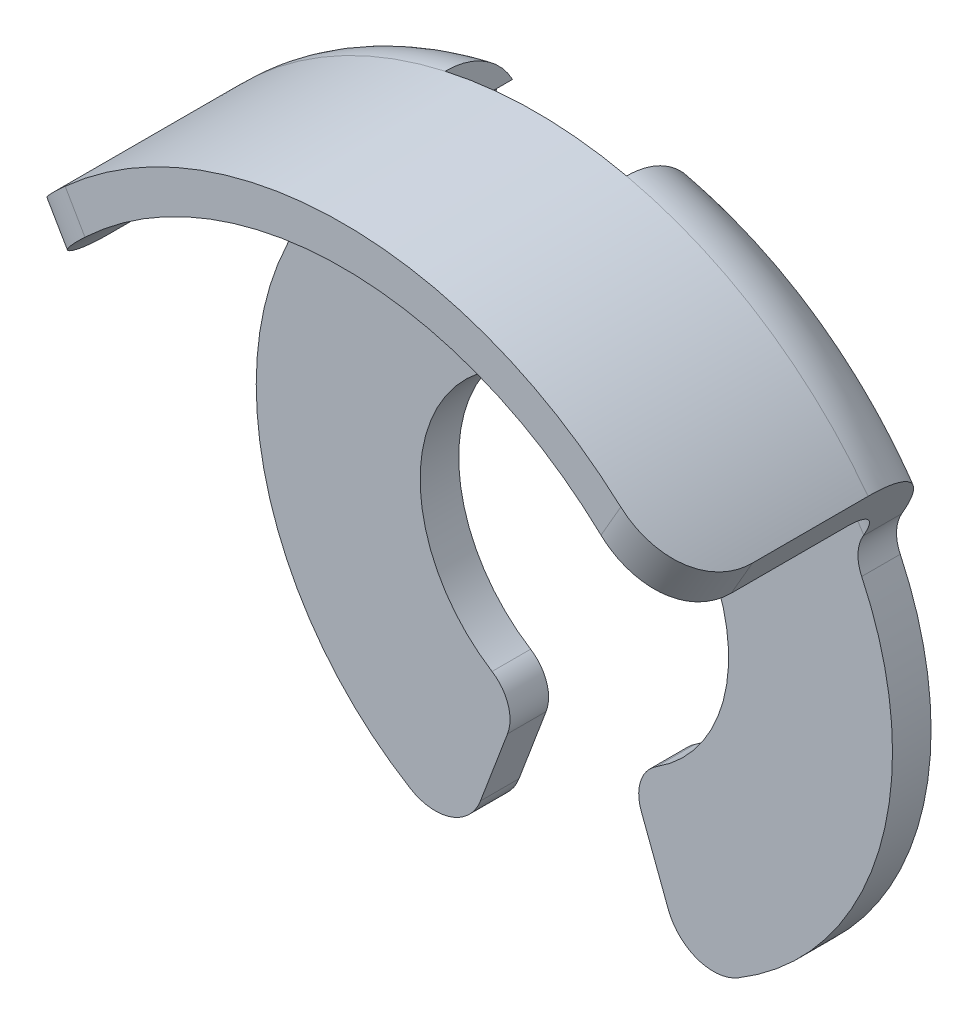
ISO-10303-21;
HEADER;
FILE_DESCRIPTION(('STEP AP214'),'2;1');
FILE_NAME('part.step','',(''),(''),'','','');
FILE_SCHEMA(('AUTOMOTIVE_DESIGN { 1 0 10303 214 1 1 1 1 }'));
ENDSEC;
DATA;
#1=APPLICATION_CONTEXT('core data for automotive mechanical design processes');
#2=APPLICATION_PROTOCOL_DEFINITION('international standard','automotive_design',2000,#1);
#3=PRODUCT_CONTEXT('',#1,'mechanical');
#4=PRODUCT('Part','Part','',(#3));
#5=PRODUCT_RELATED_PRODUCT_CATEGORY('part','',(#4));
#6=PRODUCT_DEFINITION_FORMATION('','',#4);
#7=PRODUCT_DEFINITION_CONTEXT('part definition',#1,'design');
#8=PRODUCT_DEFINITION('design','',#6,#7);
#9=PRODUCT_DEFINITION_SHAPE('','',#8);
#10=(LENGTH_UNIT() NAMED_UNIT(*) SI_UNIT(.MILLI.,.METRE.));
#11=(NAMED_UNIT(*) PLANE_ANGLE_UNIT() SI_UNIT($,.RADIAN.));
#12=(NAMED_UNIT(*) SI_UNIT($,.STERADIAN.) SOLID_ANGLE_UNIT());
#13=UNCERTAINTY_MEASURE_WITH_UNIT(LENGTH_MEASURE(1.E-05),#10,'distance_accuracy_value','');
#14=(GEOMETRIC_REPRESENTATION_CONTEXT(3) GLOBAL_UNCERTAINTY_ASSIGNED_CONTEXT((#13)) GLOBAL_UNIT_ASSIGNED_CONTEXT((#10,
#11,#12)) REPRESENTATION_CONTEXT('',''));
#15=CARTESIAN_POINT('',(0.,0.,0.));
#16=DIRECTION('',(0.,0.,1.));
#17=DIRECTION('',(1.,0.,0.));
#18=AXIS2_PLACEMENT_3D('',#15,#16,#17);
#19=CARTESIAN_POINT('',(0.,0.,-2.4));
#20=DIRECTION('',(0.,0.,1.));
#21=DIRECTION('',(1.,0.,0.));
#22=AXIS2_PLACEMENT_3D('',#19,#20,#21);
#23=CYLINDRICAL_SURFACE('',#22,3.9);
#24=CARTESIAN_POINT('',(0.,0.,-2.));
#25=DIRECTION('',(0.,0.,1.));
#26=DIRECTION('',(1.,0.,0.));
#27=AXIS2_PLACEMENT_3D('',#24,#25,#26);
#28=CIRCLE('',#27,3.9);
#29=CARTESIAN_POINT('',(-3.22692408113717,2.1901965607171,-2.));
#30=VERTEX_POINT('',#29);
#31=CARTESIAN_POINT('',(-0.941409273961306,3.78467284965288,-2.));
#32=VERTEX_POINT('',#31);
#33=EDGE_CURVE('E282',#30,#32,#28,.F.);
#34=ORIENTED_EDGE('',*,*,#33,.T.);
#35=CARTESIAN_POINT('',(0.,0.,-2.));
#36=DIRECTION('',(0.,0.,1.));
#37=DIRECTION('',(1.,0.,0.));
#38=AXIS2_PLACEMENT_3D('',#35,#36,#37);
#39=CIRCLE('',#38,3.9);
#40=CARTESIAN_POINT('',(0.941409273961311,3.78467284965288,-2.));
#41=VERTEX_POINT('',#40);
#42=EDGE_CURVE('E268',#32,#41,#39,.F.);
#43=ORIENTED_EDGE('',*,*,#42,.T.);
#44=CARTESIAN_POINT('',(3.22692408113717,2.1901965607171,-2.));
#45=VERTEX_POINT('',#44);
#46=EDGE_CURVE('E275',#41,#45,#39,.F.);
#47=ORIENTED_EDGE('',*,*,#46,.T.);
#48=DIRECTION('',(0.,0.,1.));
#49=VECTOR('',#48,1.);
#50=CARTESIAN_POINT('',(3.22692408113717,2.1901965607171,-2.4));
#51=LINE('',#50,#49);
#52=CARTESIAN_POINT('',(3.22692408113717,2.1901965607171,-0.8));
#53=VERTEX_POINT('',#52);
#54=EDGE_CURVE('E616',#45,#53,#51,.T.);
#55=ORIENTED_EDGE('',*,*,#54,.T.);
#56=CARTESIAN_POINT('',(3.22692408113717,2.1901965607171,-0.8));
#57=CARTESIAN_POINT('',(3.22692411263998,2.1901945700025,-0.778883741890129));
#58=CARTESIAN_POINT('',(3.22640212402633,2.19096577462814,-0.757778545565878));
#59=CARTESIAN_POINT('',(3.22432066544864,2.19402858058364,-0.715737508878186));
#60=CARTESIAN_POINT('',(3.22276155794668,2.19631965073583,-0.694801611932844));
#61=CARTESIAN_POINT('',(3.21655823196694,2.2054046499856,-0.632650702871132));
#62=CARTESIAN_POINT('',(3.21038783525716,2.21441092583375,-0.591882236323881));
#63=CARTESIAN_POINT('',(3.1941499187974,2.23776788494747,-0.512807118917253));
#64=CARTESIAN_POINT('',(3.18408599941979,2.25211363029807,-0.474498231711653));
#65=CARTESIAN_POINT('',(3.16028432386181,2.28539286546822,-0.40112681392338));
#66=CARTESIAN_POINT('',(3.1465434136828,2.3043302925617,-0.366067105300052));
#67=CARTESIAN_POINT('',(3.11483771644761,2.34702520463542,-0.298185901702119));
#68=CARTESIAN_POINT('',(3.09669043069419,2.37098213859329,-0.265575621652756));
#69=CARTESIAN_POINT('',(3.05690592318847,2.42205989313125,-0.205337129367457));
#70=CARTESIAN_POINT('',(3.03526723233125,2.44918204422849,-0.17771102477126));
#71=CARTESIAN_POINT('',(2.98686297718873,2.50803054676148,-0.12586714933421));
#72=CARTESIAN_POINT('',(2.95981968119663,2.53995226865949,-0.102129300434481));
#73=CARTESIAN_POINT('',(2.90247985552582,2.60528282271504,-0.0617035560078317));
#74=CARTESIAN_POINT('',(2.87218481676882,2.63869096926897,-0.0450124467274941));
#75=CARTESIAN_POINT('',(2.81469037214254,2.69980349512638,-0.0215382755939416));
#76=CARTESIAN_POINT('',(2.78792638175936,2.72744314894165,-0.013507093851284));
#77=CARTESIAN_POINT('',(2.73306297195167,2.78242768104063,-0.00273233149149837));
#78=CARTESIAN_POINT('',(2.70496340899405,2.80977252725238,1.06794868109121E-05));
#79=CARTESIAN_POINT('',(2.6764156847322,2.83668804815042,0.));
#80=B_SPLINE_CURVE_WITH_KNOTS('',3,(#56,#57,#58,#59,#60,#61,#62,#63,#64,#65,#66,#67,#68,#69,#70,
#71,#72,#73,#74,#75,#76,#77,#78,#79),.UNSPECIFIED.,.F.,.F.,(4,2,2,2,2,2,2,2,2,2,2,4),(0.,
0.0633067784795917,0.126591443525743,0.252538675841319,0.378369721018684,0.504309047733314,
0.636797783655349,0.769342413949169,0.912999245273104,1.05659048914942,1.17413290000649,
1.29168797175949),.UNSPECIFIED.);
#81=CARTESIAN_POINT('',(2.6764156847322,2.83668804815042,0.));
#82=VERTEX_POINT('',#81);
#83=EDGE_CURVE('E381',#53,#82,#80,.T.);
#84=ORIENTED_EDGE('',*,*,#83,.T.);
#85=CARTESIAN_POINT('',(0.,0.,0.));
#86=DIRECTION('',(0.,0.,1.));
#87=DIRECTION('',(1.,0.,0.));
#88=AXIS2_PLACEMENT_3D('',#85,#86,#87);
#89=CIRCLE('',#88,3.9);
#90=CARTESIAN_POINT('',(-2.6764156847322,2.83668804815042,0.));
#91=VERTEX_POINT('',#90);
#92=EDGE_CURVE('E603',#82,#91,#89,.T.);
#93=ORIENTED_EDGE('',*,*,#92,.T.);
#94=CARTESIAN_POINT('',(-2.6764156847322,2.83668804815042,0.));
#95=CARTESIAN_POINT('',(-2.71142532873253,2.8037008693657,2.68081546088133E-05));
#96=CARTESIAN_POINT('',(-2.74574423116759,2.77005442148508,-0.00410540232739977));
#97=CARTESIAN_POINT('',(-2.81216449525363,2.70257299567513,-0.020226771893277));
#98=CARTESIAN_POINT('',(-2.84426986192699,2.66873848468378,-0.0322013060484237));
#99=CARTESIAN_POINT('',(-2.90554277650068,2.60190232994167,-0.0635391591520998));
#100=CARTESIAN_POINT('',(-2.93471224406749,2.5689001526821,-0.0828976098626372));
#101=CARTESIAN_POINT('',(-2.98961876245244,2.5047870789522,-0.128459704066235));
#102=CARTESIAN_POINT('',(-3.01535410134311,2.47367712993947,-0.154666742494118));
#103=CARTESIAN_POINT('',(-3.06349939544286,2.4138110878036,-0.214018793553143));
#104=CARTESIAN_POINT('',(-3.08581685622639,2.38512760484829,-0.247312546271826));
#105=CARTESIAN_POINT('',(-3.12596425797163,2.33226313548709,-0.319708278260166));
#106=CARTESIAN_POINT('',(-3.14379426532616,2.30808208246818,-0.358810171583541));
#107=CARTESIAN_POINT('',(-3.17402527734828,2.26632026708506,-0.440410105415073));
#108=CARTESIAN_POINT('',(-3.18659267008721,2.24854021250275,-0.482743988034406));
#109=CARTESIAN_POINT('',(-3.2067974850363,2.21963193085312,-0.570694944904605));
#110=CARTESIAN_POINT('',(-3.2144448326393,2.208490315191,-0.61630520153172));
#111=CARTESIAN_POINT('',(-3.22197626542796,2.1974726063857,-0.68535283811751));
#112=CARTESIAN_POINT('',(-3.22383036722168,2.19474941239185,-0.708164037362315));
#113=CARTESIAN_POINT('',(-3.22630374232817,2.19111081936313,-0.753978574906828));
#114=CARTESIAN_POINT('',(-3.22692396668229,2.19019402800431,-0.776981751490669));
#115=CARTESIAN_POINT('',(-3.22692408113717,2.1901965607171,-0.8));
#116=B_SPLINE_CURVE_WITH_KNOTS('',3,(#94,#95,#96,#97,#98,#99,#100,#101,#102,#103,#104,#105,#106,
#107,#108,#109,#110,#111,#112,#113,#114,#115),.UNSPECIFIED.,.F.,.F.,(4,2,2,2,2,2,2,2,2,2,4),(0.,
0.144048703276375,0.28782953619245,0.431515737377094,0.575273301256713,0.722413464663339,
0.869551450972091,1.01160232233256,1.15336572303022,1.2224179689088,1.29141697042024),.UNSPECIFIED.);
#117=CARTESIAN_POINT('',(-3.22692408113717,2.1901965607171,-0.8));
#118=VERTEX_POINT('',#117);
#119=EDGE_CURVE('E372',#91,#118,#116,.T.);
#120=ORIENTED_EDGE('',*,*,#119,.T.);
#121=DIRECTION('',(0.,0.,1.));
#122=VECTOR('',#121,1.);
#123=CARTESIAN_POINT('',(-3.22692408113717,2.1901965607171,-2.4));
#124=LINE('',#123,#122);
#125=EDGE_CURVE('E622',#118,#30,#124,.F.);
#126=ORIENTED_EDGE('',*,*,#125,.T.);
#127=EDGE_LOOP('',(#34,#43,#47,#55,#84,#93,#120,#126));
#128=FACE_BOUND('',#127,.T.);
#129=ADVANCED_FACE('F39',(#128),#23,.F.);
#130=CARTESIAN_POINT('',(-0.721963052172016,3.32246434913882,-2.8));
#131=DIRECTION('',(0.,0.,1.));
#132=DIRECTION('',(1.,0.,0.));
#133=AXIS2_PLACEMENT_3D('',#130,#131,#132);
#134=CYLINDRICAL_SURFACE('',#133,0.5);
#135=DIRECTION('',(0.,0.,1.));
#136=VECTOR('',#135,1.);
#137=CARTESIAN_POINT('',(-0.941409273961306,3.77173415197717,-2.8));
#138=LINE('',#137,#136);
#139=CARTESIAN_POINT('',(-0.941409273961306,3.77173415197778,-2.09942958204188));
#140=VERTEX_POINT('',#139);
#141=CARTESIAN_POINT('',(-0.941409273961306,3.77173415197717,-2.69991873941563));
#142=VERTEX_POINT('',#141);
#143=EDGE_CURVE('E782',#140,#142,#138,.F.);
#144=ORIENTED_EDGE('',*,*,#143,.F.);
#145=CARTESIAN_POINT('',(-1.22019188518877,3.28041640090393,-2.4));
#146=CARTESIAN_POINT('',(-1.2220314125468,3.30185750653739,-2.40001461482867));
#147=CARTESIAN_POINT('',(-1.2224219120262,3.32333365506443,-2.39839079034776));
#148=CARTESIAN_POINT('',(-1.22053595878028,3.36559186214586,-2.39239359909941));
#149=CARTESIAN_POINT('',(-1.21828377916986,3.38637846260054,-2.38804542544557));
#150=CARTESIAN_POINT('',(-1.21138478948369,3.42681126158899,-2.37713406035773));
#151=CARTESIAN_POINT('',(-1.20674908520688,3.4464622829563,-2.37058119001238));
#152=CARTESIAN_POINT('',(-1.19539925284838,3.48449115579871,-2.35570480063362));
#153=CARTESIAN_POINT('',(-1.18867967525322,3.50286551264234,-2.34737665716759));
#154=CARTESIAN_POINT('',(-1.16963537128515,3.54701535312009,-2.3248057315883));
#155=CARTESIAN_POINT('',(-1.15619119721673,3.57186637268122,-2.30969461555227));
#156=CARTESIAN_POINT('',(-1.12617802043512,3.61805145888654,-2.2773546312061));
#157=CARTESIAN_POINT('',(-1.10960295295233,3.63937854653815,-2.26012167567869));
#158=CARTESIAN_POINT('',(-1.06857000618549,3.68448088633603,-2.21872979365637));
#159=CARTESIAN_POINT('',(-1.04325205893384,3.70700806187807,-2.19406522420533));
#160=CARTESIAN_POINT('',(-0.989637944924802,3.74607998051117,-2.14335902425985));
#161=CARTESIAN_POINT('',(-0.961342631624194,3.7626264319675,-2.11731778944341));
#162=CARTESIAN_POINT('',(-0.915841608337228,3.78368910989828,-2.07643644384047));
#163=CARTESIAN_POINT('',(-0.899359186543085,3.79027149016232,-2.06181539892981));
#164=CARTESIAN_POINT('',(-0.865889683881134,3.80162694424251,-2.03248494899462));
#165=CARTESIAN_POINT('',(-0.848903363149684,3.8064026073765,-2.01777570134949));
#166=CARTESIAN_POINT('',(-0.830528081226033,3.81053722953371,-2.00204675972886));
#167=CARTESIAN_POINT('',(-0.829331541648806,3.81080184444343,-2.00102336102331));
#168=CARTESIAN_POINT('',(-0.828134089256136,3.81106204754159,-2.));
#169=B_SPLINE_CURVE_WITH_KNOTS('',3,(#145,#146,#147,#148,#149,#150,#151,#152,#153,#154,#155,
#156,#157,#158,#159,#160,#161,#162,#163,#164,#165,#166,#167,#168),.UNSPECIFIED.,.F.,.F.,(4,2,2,
2,2,2,2,2,2,2,2,4),(0.,0.0643221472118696,0.128058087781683,0.191499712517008,0.255108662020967,
0.350703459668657,0.446485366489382,0.571578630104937,0.696636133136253,0.765558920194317,
0.834382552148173,0.839172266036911),.UNSPECIFIED.);
#170=CARTESIAN_POINT('',(-1.22019188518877,3.28041640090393,-2.4));
#171=VERTEX_POINT('',#170);
#172=EDGE_CURVE('E464',#140,#171,#169,.F.);
#173=ORIENTED_EDGE('',*,*,#172,.T.);
#174=CARTESIAN_POINT('',(-0.721963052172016,3.32246434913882,-2.4));
#175=DIRECTION('',(0.,0.,1.));
#176=DIRECTION('',(-1.,0.,0.));
#177=AXIS2_PLACEMENT_3D('',#174,#175,#176);
#178=CIRCLE('',#177,0.5);
#179=CARTESIAN_POINT('',(-1.1896352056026,3.14559502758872,-2.4));
#180=VERTEX_POINT('',#179);
#181=EDGE_CURVE('E549',#171,#180,#178,.T.);
#182=ORIENTED_EDGE('',*,*,#181,.T.);
#183=DIRECTION('',(0.,0.,1.));
#184=VECTOR('',#183,1.);
#185=CARTESIAN_POINT('',(-1.1896352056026,3.14559502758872,-2.8));
#186=LINE('',#185,#184);
#187=CARTESIAN_POINT('',(-1.1896352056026,3.14559502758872,-2.8));
#188=VERTEX_POINT('',#187);
#189=EDGE_CURVE('E554',#188,#180,#186,.T.);
#190=ORIENTED_EDGE('',*,*,#189,.F.);
#191=CARTESIAN_POINT('',(-0.721963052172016,3.32246434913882,-2.8));
#192=DIRECTION('',(0.,0.,1.));
#193=DIRECTION('',(-1.,0.,0.));
#194=AXIS2_PLACEMENT_3D('',#191,#192,#193);
#195=CIRCLE('',#194,0.5);
#196=CARTESIAN_POINT('',(-1.22019188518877,3.28041640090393,-2.8));
#197=VERTEX_POINT('',#196);
#198=EDGE_CURVE('E523',#197,#188,#195,.T.);
#199=ORIENTED_EDGE('',*,*,#198,.F.);
#200=CARTESIAN_POINT('',(-1.22019188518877,3.28041640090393,-2.8));
#201=CARTESIAN_POINT('',(-1.22245499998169,3.30690111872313,-2.80002274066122));
#202=CARTESIAN_POINT('',(-1.2225478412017,3.33350854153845,-2.79877124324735));
#203=CARTESIAN_POINT('',(-1.21858521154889,3.38610885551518,-2.79424845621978));
#204=CARTESIAN_POINT('',(-1.21455105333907,3.41210420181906,-2.79098757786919));
#205=CARTESIAN_POINT('',(-1.20255922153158,3.46285179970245,-2.78297308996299));
#206=CARTESIAN_POINT('',(-1.19461015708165,3.48760664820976,-2.77822276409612));
#207=CARTESIAN_POINT('',(-1.17506720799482,3.53545510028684,-2.76780412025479));
#208=CARTESIAN_POINT('',(-1.1634684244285,3.55854641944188,-2.76213457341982));
#209=CARTESIAN_POINT('',(-1.13590755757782,3.604271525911,-2.75003025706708));
#210=CARTESIAN_POINT('',(-1.11968320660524,3.62674071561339,-2.74356999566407));
#211=CARTESIAN_POINT('',(-1.0836827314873,3.66876552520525,-2.7310120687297));
#212=CARTESIAN_POINT('',(-1.06390506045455,3.68831986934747,-2.72491456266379));
#213=CARTESIAN_POINT('',(-1.02037359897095,3.72469068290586,-2.71361558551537));
#214=CARTESIAN_POINT('',(-0.996496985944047,3.74137438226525,-2.7084571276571));
#215=CARTESIAN_POINT('',(-0.945965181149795,3.77042328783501,-2.70012257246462));
#216=CARTESIAN_POINT('',(-0.919316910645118,3.78279893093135,-2.69694166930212));
#217=CARTESIAN_POINT('',(-0.881372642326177,3.79650156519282,-2.69428706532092));
#218=CARTESIAN_POINT('',(-0.870864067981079,3.79990633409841,-2.69373850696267));
#219=CARTESIAN_POINT('',(-0.849642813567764,3.80601303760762,-2.69300512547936));
#220=CARTESIAN_POINT('',(-0.838930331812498,3.8087156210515,-2.69281996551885));
#221=CARTESIAN_POINT('',(-0.828134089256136,3.81106204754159,-2.69282032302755));
#222=B_SPLINE_CURVE_WITH_KNOTS('',3,(#200,#201,#202,#203,#204,#205,#206,#207,#208,#209,#210,
#211,#212,#213,#214,#215,#216,#217,#218,#219,#220,#221),.UNSPECIFIED.,.F.,.F.,(4,2,2,2,2,2,2,2,
2,2,4),(0.,0.0795377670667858,0.158666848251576,0.237622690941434,0.31668496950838,
0.401684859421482,0.486721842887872,0.575000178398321,0.663063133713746,0.696218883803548,
0.729343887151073),.UNSPECIFIED.);
#223=EDGE_CURVE('E382',#197,#142,#222,.T.);
#224=ORIENTED_EDGE('',*,*,#223,.T.);
#225=EDGE_LOOP('',(#144,#173,#182,#190,#199,#224));
#226=FACE_BOUND('',#225,.T.);
#227=ADVANCED_FACE('F397',(#226),#134,.F.);
#228=CARTESIAN_POINT('',(0.721963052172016,3.32246434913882,-2.8));
#229=DIRECTION('',(0.,0.,1.));
#230=DIRECTION('',(1.,0.,0.));
#231=AXIS2_PLACEMENT_3D('',#228,#229,#230);
#232=CYLINDRICAL_SURFACE('',#231,0.5);
#233=DIRECTION('',(0.,0.,1.));
#234=VECTOR('',#233,1.);
#235=CARTESIAN_POINT('',(0.941409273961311,3.77173415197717,-2.8));
#236=LINE('',#235,#234);
#237=CARTESIAN_POINT('',(0.941409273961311,3.77173415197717,-2.69991873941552));
#238=VERTEX_POINT('',#237);
#239=CARTESIAN_POINT('',(0.941409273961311,3.77173415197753,-2.09942958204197));
#240=VERTEX_POINT('',#239);
#241=EDGE_CURVE('E260',#238,#240,#236,.T.);
#242=ORIENTED_EDGE('',*,*,#241,.F.);
#243=CARTESIAN_POINT('',(0.828134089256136,3.81106204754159,-2.69282032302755));
#244=CARTESIAN_POINT('',(0.854157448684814,3.80543755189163,-2.69277276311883));
#245=CARTESIAN_POINT('',(0.879674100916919,3.79768890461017,-2.69388992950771));
#246=CARTESIAN_POINT('',(0.92891270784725,3.77838031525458,-2.69806941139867));
#247=CARTESIAN_POINT('',(0.952642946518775,3.76683949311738,-2.70112203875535));
#248=CARTESIAN_POINT('',(0.997765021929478,3.74033981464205,-2.70878935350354));
#249=CARTESIAN_POINT('',(1.01916031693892,3.72538611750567,-2.7134016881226));
#250=CARTESIAN_POINT('',(1.0592562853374,3.69247324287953,-2.72362244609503));
#251=CARTESIAN_POINT('',(1.07795364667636,3.67451042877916,-2.72923207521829));
#252=CARTESIAN_POINT('',(1.11344383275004,3.63471451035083,-2.74123294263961));
#253=CARTESIAN_POINT('',(1.13002852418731,3.61270387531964,-2.74765134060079));
#254=CARTESIAN_POINT('',(1.15940468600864,3.56618899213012,-2.7602108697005));
#255=CARTESIAN_POINT('',(1.17219382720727,3.54168322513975,-2.76635182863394));
#256=CARTESIAN_POINT('',(1.19411401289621,3.48952716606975,-2.77788868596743));
#257=CARTESIAN_POINT('',(1.20305119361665,3.46178435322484,-2.7832377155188));
#258=CARTESIAN_POINT('',(1.21597521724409,3.40490866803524,-2.79201362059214));
#259=CARTESIAN_POINT('',(1.21997519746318,3.375779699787,-2.79544558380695));
#260=CARTESIAN_POINT('',(1.22191580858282,3.33547593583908,-2.79835752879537));
#261=CARTESIAN_POINT('',(1.22208088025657,3.32445549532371,-2.7989669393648));
#262=CARTESIAN_POINT('',(1.22168226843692,3.30242091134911,-2.79978807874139));
#263=CARTESIAN_POINT('',(1.22111909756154,3.29140676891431,-2.80000008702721));
#264=CARTESIAN_POINT('',(1.22019188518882,3.28041640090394,-2.80000000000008));
#265=B_SPLINE_CURVE_WITH_KNOTS('',3,(#243,#244,#245,#246,#247,#248,#249,#250,#251,#252,#253,
#254,#255,#256,#257,#258,#259,#260,#261,#262,#263,#264),.UNSPECIFIED.,.F.,.F.,(4,2,2,2,2,2,2,2,
2,2,4),(0.,0.0796929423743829,0.158990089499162,0.238168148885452,0.317442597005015,
0.401967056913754,0.48654327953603,0.574984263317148,0.663189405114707,0.696279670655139,
0.729346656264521),.UNSPECIFIED.);
#266=CARTESIAN_POINT('',(1.22019188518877,3.28041640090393,-2.8));
#267=VERTEX_POINT('',#266);
#268=EDGE_CURVE('E751',#238,#267,#265,.T.);
#269=ORIENTED_EDGE('',*,*,#268,.T.);
#270=CARTESIAN_POINT('',(0.721963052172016,3.32246434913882,-2.8));
#271=DIRECTION('',(0.,0.,1.));
#272=DIRECTION('',(-1.,0.,0.));
#273=AXIS2_PLACEMENT_3D('',#270,#271,#272);
#274=CIRCLE('',#273,0.5);
#275=CARTESIAN_POINT('',(1.1896352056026,3.14559502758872,-2.8));
#276=VERTEX_POINT('',#275);
#277=EDGE_CURVE('E519',#276,#267,#274,.T.);
#278=ORIENTED_EDGE('',*,*,#277,.F.);
#279=DIRECTION('',(0.,0.,1.));
#280=VECTOR('',#279,1.);
#281=CARTESIAN_POINT('',(1.1896352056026,3.14559502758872,-2.8));
#282=LINE('',#281,#280);
#283=CARTESIAN_POINT('',(1.1896352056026,3.14559502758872,-2.4));
#284=VERTEX_POINT('',#283);
#285=EDGE_CURVE('E559',#276,#284,#282,.T.);
#286=ORIENTED_EDGE('',*,*,#285,.T.);
#287=CARTESIAN_POINT('',(0.721963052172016,3.32246434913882,-2.4));
#288=DIRECTION('',(0.,0.,1.));
#289=DIRECTION('',(-1.,0.,0.));
#290=AXIS2_PLACEMENT_3D('',#287,#288,#289);
#291=CIRCLE('',#290,0.5);
#292=CARTESIAN_POINT('',(1.22019188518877,3.28041640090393,-2.4));
#293=VERTEX_POINT('',#292);
#294=EDGE_CURVE('E545',#284,#293,#291,.T.);
#295=ORIENTED_EDGE('',*,*,#294,.T.);
#296=CARTESIAN_POINT('',(1.22019188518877,3.28041640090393,-2.4));
#297=CARTESIAN_POINT('',(1.2220314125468,3.30185750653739,-2.40001461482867));
#298=CARTESIAN_POINT('',(1.2224219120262,3.32333365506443,-2.39839079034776));
#299=CARTESIAN_POINT('',(1.22053595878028,3.36559186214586,-2.39239359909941));
#300=CARTESIAN_POINT('',(1.21828377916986,3.38637846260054,-2.38804542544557));
#301=CARTESIAN_POINT('',(1.21138478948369,3.42681126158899,-2.37713406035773));
#302=CARTESIAN_POINT('',(1.20674908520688,3.44646228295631,-2.37058119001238));
#303=CARTESIAN_POINT('',(1.19539925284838,3.48449115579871,-2.35570480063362));
#304=CARTESIAN_POINT('',(1.18867967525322,3.50286551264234,-2.34737665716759));
#305=CARTESIAN_POINT('',(1.16963537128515,3.54701535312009,-2.3248057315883));
#306=CARTESIAN_POINT('',(1.15619119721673,3.57186637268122,-2.30969461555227));
#307=CARTESIAN_POINT('',(1.12617802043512,3.61805145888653,-2.2773546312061));
#308=CARTESIAN_POINT('',(1.10960295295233,3.63937854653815,-2.26012167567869));
#309=CARTESIAN_POINT('',(1.06857000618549,3.68448088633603,-2.21872979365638));
#310=CARTESIAN_POINT('',(1.04325205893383,3.70700806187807,-2.19406522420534));
#311=CARTESIAN_POINT('',(0.98963794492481,3.74607998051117,-2.14335902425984));
#312=CARTESIAN_POINT('',(0.961342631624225,3.76262643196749,-2.11731778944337));
#313=CARTESIAN_POINT('',(0.915841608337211,3.78368910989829,-2.07643644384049));
#314=CARTESIAN_POINT('',(0.899359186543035,3.79027149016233,-2.06181539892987));
#315=CARTESIAN_POINT('',(0.865889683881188,3.80162694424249,-2.03248494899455));
#316=CARTESIAN_POINT('',(0.848903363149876,3.80640260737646,-2.01777570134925));
#317=CARTESIAN_POINT('',(0.830528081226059,3.8105372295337,-2.00204675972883));
#318=CARTESIAN_POINT('',(0.82933154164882,3.81080184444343,-2.0010233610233));
#319=CARTESIAN_POINT('',(0.828134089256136,3.81106204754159,-2.));
#320=B_SPLINE_CURVE_WITH_KNOTS('',3,(#296,#297,#298,#299,#300,#301,#302,#303,#304,#305,#306,
#307,#308,#309,#310,#311,#312,#313,#314,#315,#316,#317,#318,#319),.UNSPECIFIED.,.F.,.F.,(4,2,2,
2,2,2,2,2,2,2,2,4),(0.,0.0643221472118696,0.128058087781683,0.191499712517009,0.255108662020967,
0.350703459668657,0.446485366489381,0.571578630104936,0.696636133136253,0.765558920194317,
0.834382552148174,0.839172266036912),.UNSPECIFIED.);
#321=EDGE_CURVE('E305',#293,#240,#320,.T.);
#322=ORIENTED_EDGE('',*,*,#321,.T.);
#323=EDGE_LOOP('',(#242,#269,#278,#286,#295,#322));
#324=FACE_BOUND('',#323,.T.);
#325=ADVANCED_FACE('F319',(#324),#232,.F.);
#326=CARTESIAN_POINT('',(0.,0.,-2.));
#327=DIRECTION('',(0.,0.,1.));
#328=DIRECTION('',(1.,0.,0.));
#329=AXIS2_PLACEMENT_3D('',#326,#327,#328);
#330=TOROIDAL_SURFACE('',#329,3.5,0.8);
#331=ORIENTED_EDGE('',*,*,#268,.F.);
#332=CARTESIAN_POINT('',(0.941409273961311,2.76398937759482,-2.55090691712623));
#333=CARTESIAN_POINT('',(0.941409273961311,2.79794959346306,-2.58475352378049));
#334=CARTESIAN_POINT('',(0.941409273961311,2.83488190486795,-2.61568204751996));
#335=CARTESIAN_POINT('',(0.941409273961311,2.91347074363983,-2.6709065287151));
#336=CARTESIAN_POINT('',(0.941409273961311,2.95513582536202,-2.6951901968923));
#337=CARTESIAN_POINT('',(0.941409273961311,3.04184817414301,-2.73646581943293));
#338=CARTESIAN_POINT('',(0.941409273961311,3.08688953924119,-2.75347016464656));
#339=CARTESIAN_POINT('',(0.941409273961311,3.17913915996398,-2.77981403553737));
#340=CARTESIAN_POINT('',(0.941409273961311,3.22634660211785,-2.789156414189));
#341=CARTESIAN_POINT('',(0.941409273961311,3.32246999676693,-2.80000784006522));
#342=CARTESIAN_POINT('',(0.941409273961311,3.3714013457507,-2.80138142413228));
#343=CARTESIAN_POINT('',(0.941409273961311,3.46879779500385,-2.79581959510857));
#344=CARTESIAN_POINT('',(0.941409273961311,3.51726286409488,-2.78888363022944));
#345=CARTESIAN_POINT('',(0.941409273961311,3.61186188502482,-2.76689629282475));
#346=CARTESIAN_POINT('',(0.941409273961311,3.65801287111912,-2.75191840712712));
#347=CARTESIAN_POINT('',(0.941409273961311,3.74703694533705,-2.71421521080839));
#348=CARTESIAN_POINT('',(0.941409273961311,3.78991050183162,-2.69149100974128));
#349=CARTESIAN_POINT('',(0.941409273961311,3.86991558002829,-2.63958020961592));
#350=CARTESIAN_POINT('',(0.941409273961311,3.90717058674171,-2.61058399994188));
#351=CARTESIAN_POINT('',(0.941409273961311,3.97609002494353,-2.54656991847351));
#352=CARTESIAN_POINT('',(0.941409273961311,4.00775543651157,-2.51155310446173));
#353=CARTESIAN_POINT('',(0.941409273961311,4.06358350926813,-2.43764063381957));
#354=CARTESIAN_POINT('',(0.941409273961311,4.08794452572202,-2.39889475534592));
#355=CARTESIAN_POINT('',(0.941409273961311,4.12963098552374,-2.31778645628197));
#356=CARTESIAN_POINT('',(0.941409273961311,4.14695744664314,-2.27542455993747));
#357=CARTESIAN_POINT('',(0.941409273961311,4.17367740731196,-2.18937488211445));
#358=CARTESIAN_POINT('',(0.941409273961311,4.18324968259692,-2.14574255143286));
#359=CARTESIAN_POINT('',(0.941409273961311,4.19483250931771,-2.05748642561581));
#360=CARTESIAN_POINT('',(0.941409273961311,4.19684372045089,-2.01286271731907));
#361=CARTESIAN_POINT('',(0.941409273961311,4.19326239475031,-1.92446999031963));
#362=CARTESIAN_POINT('',(0.941409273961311,4.18776237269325,-1.88069718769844));
#363=CARTESIAN_POINT('',(0.941409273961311,4.16949739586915,-1.79469651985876));
#364=CARTESIAN_POINT('',(0.941409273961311,4.15673257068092,-1.75246862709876));
#365=CARTESIAN_POINT('',(0.941409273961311,4.12432155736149,-1.67069405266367));
#366=CARTESIAN_POINT('',(0.941409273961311,4.10466821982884,-1.63115020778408));
#367=CARTESIAN_POINT('',(0.941409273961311,4.05908778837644,-1.55586396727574));
#368=CARTESIAN_POINT('',(0.941409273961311,4.03316039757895,-1.52012175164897));
#369=CARTESIAN_POINT('',(0.941409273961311,3.97540856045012,-1.45290590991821));
#370=CARTESIAN_POINT('',(0.941409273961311,3.9435076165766,-1.42149805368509));
#371=CARTESIAN_POINT('',(0.941409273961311,3.87499495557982,-1.36433270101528));
#372=CARTESIAN_POINT('',(0.941409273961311,3.83838275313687,-1.33857578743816));
#373=CARTESIAN_POINT('',(0.941409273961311,3.7605508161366,-1.29276406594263));
#374=CARTESIAN_POINT('',(0.941409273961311,3.71924101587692,-1.27286234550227));
#375=CARTESIAN_POINT('',(0.941409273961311,3.63393431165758,-1.24005116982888));
#376=CARTESIAN_POINT('',(0.941409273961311,3.58993702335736,-1.22714271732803));
#377=CARTESIAN_POINT('',(0.941409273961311,3.49911110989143,-1.20828189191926));
#378=CARTESIAN_POINT('',(0.941409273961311,3.45223720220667,-1.20254755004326));
#379=CARTESIAN_POINT('',(0.941409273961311,3.3581818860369,-1.19880977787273));
#380=CARTESIAN_POINT('',(0.941409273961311,3.31100043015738,-1.20080756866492));
#381=CARTESIAN_POINT('',(0.941409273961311,3.21634552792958,-1.21257739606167));
#382=CARTESIAN_POINT('',(0.941409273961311,3.16889741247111,-1.22255382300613));
#383=CARTESIAN_POINT('',(0.941409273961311,3.07631161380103,-1.25024843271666));
#384=CARTESIAN_POINT('',(0.941409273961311,3.03117421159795,-1.26796755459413));
#385=CARTESIAN_POINT('',(0.941409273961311,2.94407240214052,-1.31091249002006));
#386=CARTESIAN_POINT('',(0.941409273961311,2.90214283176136,-1.33620911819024));
#387=CARTESIAN_POINT('',(0.941409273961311,2.82323888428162,-1.39362751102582));
#388=CARTESIAN_POINT('',(0.941409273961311,2.78626429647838,-1.42574898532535));
#389=CARTESIAN_POINT('',(0.941409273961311,2.71927296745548,-1.49524097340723));
#390=CARTESIAN_POINT('',(0.941409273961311,2.68912260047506,-1.53248239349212));
#391=CARTESIAN_POINT('',(0.941409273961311,2.63591580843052,-1.61173266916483));
#392=CARTESIAN_POINT('',(0.941409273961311,2.6128568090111,-1.65373978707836));
#393=CARTESIAN_POINT('',(0.941409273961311,2.57582812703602,-1.73895714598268));
#394=CARTESIAN_POINT('',(0.941409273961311,2.56144261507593,-1.7819865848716));
#395=CARTESIAN_POINT('',(0.941409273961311,2.54055526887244,-1.86991305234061));
#396=CARTESIAN_POINT('',(0.941409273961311,2.53404998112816,-1.91480925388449));
#397=CARTESIAN_POINT('',(0.941409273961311,2.5293467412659,-2.00265531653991));
#398=CARTESIAN_POINT('',(0.941409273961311,2.53072955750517,-2.04558324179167));
#399=CARTESIAN_POINT('',(0.941409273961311,2.54077462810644,-2.13058699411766));
#400=CARTESIAN_POINT('',(0.941409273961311,2.54943823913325,-2.17266266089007));
#401=CARTESIAN_POINT('',(0.941409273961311,2.57355587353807,-2.2543312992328));
#402=CARTESIAN_POINT('',(0.941409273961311,2.58893871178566,-2.29394545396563));
#403=CARTESIAN_POINT('',(0.941409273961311,2.62589279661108,-2.37012749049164));
#404=CARTESIAN_POINT('',(0.941409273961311,2.64745732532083,-2.40669862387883));
#405=CARTESIAN_POINT('',(0.941409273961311,2.68546511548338,-2.46090270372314));
#406=CARTESIAN_POINT('',(0.941409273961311,2.7000618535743,-2.47985950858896));
#407=CARTESIAN_POINT('',(0.941409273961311,2.73085583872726,-2.51642172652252));
#408=CARTESIAN_POINT('',(0.941409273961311,2.74705300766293,-2.53402720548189));
#409=CARTESIAN_POINT('',(0.941409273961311,2.76398937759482,-2.55090691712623));
#410=B_SPLINE_CURVE_WITH_KNOTS('',3,(#332,#333,#334,#335,#336,#337,#338,#339,#340,#341,#342,
#343,#344,#345,#346,#347,#348,#349,#350,#351,#352,#353,#354,#355,#356,#357,#358,#359,#360,#361,
#362,#363,#364,#365,#366,#367,#368,#369,#370,#371,#372,#373,#374,#375,#376,#377,#378,#379,#380,
#381,#382,#383,#384,#385,#386,#387,#388,#389,#390,#391,#392,#393,#394,#395,#396,#397,#398,#399,
#400,#401,#402,#403,#404,#405,#406,#407,#408,#409),.UNSPECIFIED.,.T.,.F.,(4,2,2,2,2,2,2,2,2,2,2,
2,2,2,2,2,2,2,2,2,2,2,2,2,2,2,2,2,2,2,2,2,2,2,2,2,2,2,4),(0.,0.143749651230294,
0.287763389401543,0.431531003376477,0.575245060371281,0.72139514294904,0.867554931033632,
1.01240129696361,1.15722692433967,1.29815471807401,1.43905777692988,1.57568911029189,
1.71230066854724,1.84566499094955,1.9790176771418,2.11074260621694,2.2424651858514,
2.37432488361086,2.50619082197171,2.63987793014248,2.7735788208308,2.91051550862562,
3.04747182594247,3.18849661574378,3.32954367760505,3.47432436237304,3.61912261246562,
3.76531867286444,3.91150851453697,4.05452463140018,4.19748876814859,4.33290013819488,
4.46825214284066,4.59647993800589,4.72473163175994,4.8516563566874,4.97844366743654,
5.05013685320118,5.12182654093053),.UNSPECIFIED.);
#411=CARTESIAN_POINT('',(0.941409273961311,4.1956821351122,-2.));
#412=VERTEX_POINT('',#411);
#413=EDGE_CURVE('E491',#238,#412,#410,.T.);
#414=ORIENTED_EDGE('',*,*,#413,.T.);
#415=CARTESIAN_POINT('',(0.,0.,-2.));
#416=DIRECTION('',(0.,0.,1.));
#417=DIRECTION('',(1.,0.,0.));
#418=AXIS2_PLACEMENT_3D('',#415,#416,#417);
#419=CIRCLE('',#418,4.3);
#420=CARTESIAN_POINT('',(3.44675949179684,2.57096266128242,-2.));
#421=VERTEX_POINT('',#420);
#422=EDGE_CURVE('E429',#421,#412,#419,.T.);
#423=ORIENTED_EDGE('',*,*,#422,.F.);
#424=CARTESIAN_POINT('',(3.00165488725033,1.80001887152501,-2.8));
#425=CARTESIAN_POINT('',(3.02926453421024,1.8478401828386,-2.80003110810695));
#426=CARTESIAN_POINT('',(3.05691177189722,1.8957266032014,-2.79562975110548));
#427=CARTESIAN_POINT('',(3.11159124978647,1.99043423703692,-2.77776100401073));
#428=CARTESIAN_POINT('',(3.13861999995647,2.03724940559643,-2.76425121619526));
#429=CARTESIAN_POINT('',(3.19118149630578,2.12828858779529,-2.72790334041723));
#430=CARTESIAN_POINT('',(3.21670921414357,2.17250389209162,-2.70503573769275));
#431=CARTESIAN_POINT('',(3.26515258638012,2.2564102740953,-2.65021625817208));
#432=CARTESIAN_POINT('',(3.28807369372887,2.29611079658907,-2.6182838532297));
#433=CARTESIAN_POINT('',(3.32832539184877,2.36582878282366,-2.54941284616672));
#434=CARTESIAN_POINT('',(3.34597948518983,2.39640656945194,-2.51323153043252));
#435=CARTESIAN_POINT('',(3.37758611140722,2.4511508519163,-2.43484447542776));
#436=CARTESIAN_POINT('',(3.39153871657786,2.4753174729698,-2.39263885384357));
#437=CARTESIAN_POINT('',(3.41384971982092,2.51396126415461,-2.30814278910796));
#438=CARTESIAN_POINT('',(3.42263330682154,2.52917488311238,-2.26629929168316));
#439=CARTESIAN_POINT('',(3.43626860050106,2.55279190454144,-2.18016644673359));
#440=CARTESIAN_POINT('',(3.44112846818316,2.5612094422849,-2.13588238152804));
#441=CARTESIAN_POINT('',(3.44486877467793,2.56768784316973,-2.07602074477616));
#442=CARTESIAN_POINT('',(3.44557790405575,2.56891609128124,-2.06083902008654));
#443=CARTESIAN_POINT('',(3.44652262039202,2.5705523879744,-2.03044068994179));
#444=CARTESIAN_POINT('',(3.44675895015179,2.57096172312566,-2.01522417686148));
#445=CARTESIAN_POINT('',(3.44675949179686,2.57096266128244,-2.));
#446=B_SPLINE_CURVE_WITH_KNOTS('',3,(#424,#425,#426,#427,#428,#429,#430,#431,#432,#433,#434,
#435,#436,#437,#438,#439,#440,#441,#442,#443,#444,#445),.UNSPECIFIED.,.F.,.F.,(4,2,2,2,2,2,2,2,
2,2,4),(0.,0.165599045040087,0.331974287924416,0.49887837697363,0.665426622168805,
0.816250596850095,0.967071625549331,1.10252302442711,1.23769196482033,1.28341377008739,
1.32906368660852),.UNSPECIFIED.);
#447=CARTESIAN_POINT('',(3.00165488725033,1.80001887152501,-2.8));
#448=VERTEX_POINT('',#447);
#449=EDGE_CURVE('E741',#448,#421,#446,.T.);
#450=ORIENTED_EDGE('',*,*,#449,.F.);
#451=CARTESIAN_POINT('',(0.,0.,-2.8));
#452=DIRECTION('',(0.,0.,1.));
#453=DIRECTION('',(1.,0.,0.));
#454=AXIS2_PLACEMENT_3D('',#451,#452,#453);
#455=CIRCLE('',#454,3.5);
#456=EDGE_CURVE('E446',#267,#448,#455,.F.);
#457=ORIENTED_EDGE('',*,*,#456,.F.);
#458=EDGE_LOOP('',(#331,#414,#423,#450,#457));
#459=FACE_BOUND('',#458,.T.);
#460=ADVANCED_FACE('F418',(#459),#330,.T.);
#461=CARTESIAN_POINT('',(-0.941409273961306,4.1956821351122,-2.));
#462=VERTEX_POINT('',#461);
#463=CARTESIAN_POINT('',(-3.44675949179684,2.57096266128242,-2.));
#464=VERTEX_POINT('',#463);
#465=EDGE_CURVE('E428',#462,#464,#419,.T.);
#466=ORIENTED_EDGE('',*,*,#465,.F.);
#467=CARTESIAN_POINT('',(-0.941409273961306,2.76398937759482,-2.55090691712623));
#468=CARTESIAN_POINT('',(-0.941409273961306,2.73240922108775,-2.51942799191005));
#469=CARTESIAN_POINT('',(-0.941409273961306,2.70335498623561,-2.48538347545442));
#470=CARTESIAN_POINT('',(-0.941409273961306,2.65124961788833,-2.41293832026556));
#471=CARTESIAN_POINT('',(-0.941409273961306,2.62820221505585,-2.37453499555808));
#472=CARTESIAN_POINT('',(-0.941409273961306,2.58893569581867,-2.29427294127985));
#473=CARTESIAN_POINT('',(-0.941409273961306,2.57273015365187,-2.25240753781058));
#474=CARTESIAN_POINT('',(-0.941409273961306,2.54789999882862,-2.16649118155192));
#475=CARTESIAN_POINT('',(-0.941409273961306,2.53927257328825,-2.12244104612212));
#476=CARTESIAN_POINT('',(-0.941409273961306,2.53015500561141,-2.03517644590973));
#477=CARTESIAN_POINT('',(-0.941409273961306,2.52937239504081,-1.99199240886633));
#478=CARTESIAN_POINT('',(-0.941409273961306,2.53521722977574,-1.90613237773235));
#479=CARTESIAN_POINT('',(-0.941409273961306,2.54184405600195,-1.86345634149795));
#480=CARTESIAN_POINT('',(-0.941409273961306,2.56203910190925,-1.78060037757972));
#481=CARTESIAN_POINT('',(-0.941409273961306,2.57548088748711,-1.74038943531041));
#482=CARTESIAN_POINT('',(-0.941409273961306,2.6087191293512,-1.66269155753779));
#483=CARTESIAN_POINT('',(-0.941409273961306,2.62851636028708,-1.62520495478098));
#484=CARTESIAN_POINT('',(-0.941409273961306,2.67451081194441,-1.55269879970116));
#485=CARTESIAN_POINT('',(-0.941409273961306,2.70089234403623,-1.51779637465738));
#486=CARTESIAN_POINT('',(-0.941409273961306,2.75885168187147,-1.45261602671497));
#487=CARTESIAN_POINT('',(-0.941409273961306,2.79043078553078,-1.42233926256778));
#488=CARTESIAN_POINT('',(-0.941409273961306,2.85978583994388,-1.36548446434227));
#489=CARTESIAN_POINT('',(-0.941409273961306,2.89781000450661,-1.33920910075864));
#490=CARTESIAN_POINT('',(-0.941409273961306,2.97757831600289,-1.2930916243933));
#491=CARTESIAN_POINT('',(-0.941409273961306,3.0193233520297,-1.27325105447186));
#492=CARTESIAN_POINT('',(-0.941409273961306,3.10735667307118,-1.23971510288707));
#493=CARTESIAN_POINT('',(-0.941409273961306,3.15376449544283,-1.22633274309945));
#494=CARTESIAN_POINT('',(-0.941409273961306,3.24815763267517,-1.20742829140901));
#495=CARTESIAN_POINT('',(-0.941409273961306,3.29614312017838,-1.20190706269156));
#496=CARTESIAN_POINT('',(-0.941409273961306,3.39302601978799,-1.19890265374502));
#497=CARTESIAN_POINT('',(-0.941409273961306,3.44192695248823,-1.20152994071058));
#498=CARTESIAN_POINT('',(-0.941409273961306,3.53856929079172,-1.21508191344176));
#499=CARTESIAN_POINT('',(-0.941409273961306,3.58631075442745,-1.22600618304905));
#500=CARTESIAN_POINT('',(-0.941409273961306,3.67850655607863,-1.25572498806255));
#501=CARTESIAN_POINT('',(-0.941409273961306,3.72299893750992,-1.27440129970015));
#502=CARTESIAN_POINT('',(-0.941409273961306,3.80808163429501,-1.31917541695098));
#503=CARTESIAN_POINT('',(-0.941409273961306,3.84867254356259,-1.34527209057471));
#504=CARTESIAN_POINT('',(-0.941409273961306,3.92353574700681,-1.40334242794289));
#505=CARTESIAN_POINT('',(-0.941409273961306,3.95795692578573,-1.43512411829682));
#506=CARTESIAN_POINT('',(-0.941409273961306,4.02077434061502,-1.50417096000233));
#507=CARTESIAN_POINT('',(-0.941409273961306,4.04917160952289,-1.54143516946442));
#508=CARTESIAN_POINT('',(-0.941409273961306,4.09826078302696,-1.61920098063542));
#509=CARTESIAN_POINT('',(-0.941409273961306,4.11915490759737,-1.65957498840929));
#510=CARTESIAN_POINT('',(-0.941409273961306,4.15369874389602,-1.74331160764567));
#511=CARTESIAN_POINT('',(-0.941409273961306,4.16734942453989,-1.78667381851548));
#512=CARTESIAN_POINT('',(-0.941409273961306,4.18674607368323,-1.87416074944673));
#513=CARTESIAN_POINT('',(-0.941409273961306,4.1926540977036,-1.91824959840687));
#514=CARTESIAN_POINT('',(-0.941409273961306,4.19690953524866,-2.00678950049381));
#515=CARTESIAN_POINT('',(-0.941409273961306,4.19525747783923,-2.05124052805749));
#516=CARTESIAN_POINT('',(-0.941409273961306,4.18449643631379,-2.138818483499));
#517=CARTESIAN_POINT('',(-0.941409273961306,4.17545520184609,-2.18195376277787));
#518=CARTESIAN_POINT('',(-0.941409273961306,4.15028838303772,-2.26610328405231));
#519=CARTESIAN_POINT('',(-0.941409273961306,4.13416281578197,-2.3071175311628));
#520=CARTESIAN_POINT('',(-0.941409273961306,4.0952448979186,-2.38606395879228));
#521=CARTESIAN_POINT('',(-0.941409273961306,4.07242458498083,-2.42398234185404));
#522=CARTESIAN_POINT('',(-0.941409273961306,4.02083959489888,-2.4955299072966));
#523=CARTESIAN_POINT('',(-0.941409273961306,3.99207454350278,-2.52915881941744));
#524=CARTESIAN_POINT('',(-0.941409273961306,3.92892611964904,-2.59178929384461));
#525=CARTESIAN_POINT('',(-0.941409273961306,3.89445734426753,-2.6207046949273));
#526=CARTESIAN_POINT('',(-0.941409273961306,3.82125936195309,-2.672511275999));
#527=CARTESIAN_POINT('',(-0.941409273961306,3.78252965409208,-2.69540174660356));
#528=CARTESIAN_POINT('',(-0.941409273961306,3.70083681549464,-2.73515701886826));
#529=CARTESIAN_POINT('',(-0.941409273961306,3.65778954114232,-2.75184884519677));
#530=CARTESIAN_POINT('',(-0.941409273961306,3.5695553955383,-2.77800188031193));
#531=CARTESIAN_POINT('',(-0.941409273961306,3.52436828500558,-2.78746227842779));
#532=CARTESIAN_POINT('',(-0.941409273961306,3.43169969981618,-2.79917245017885));
#533=CARTESIAN_POINT('',(-0.941409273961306,3.38418998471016,-2.80119887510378));
#534=CARTESIAN_POINT('',(-0.941409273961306,3.28946696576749,-2.79744627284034));
#535=CARTESIAN_POINT('',(-0.941409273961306,3.24225378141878,-2.79166427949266));
#536=CARTESIAN_POINT('',(-0.941409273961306,3.14827364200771,-2.77225340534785));
#537=CARTESIAN_POINT('',(-0.941409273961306,3.10154528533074,-2.75843760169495));
#538=CARTESIAN_POINT('',(-0.941409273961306,3.01108738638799,-2.72319264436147));
#539=CARTESIAN_POINT('',(-0.941409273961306,2.96735497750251,-2.70177089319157));
#540=CARTESIAN_POINT('',(-0.941409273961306,2.89638543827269,-2.65920138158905));
#541=CARTESIAN_POINT('',(-0.941409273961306,2.8680745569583,-2.63981906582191));
#542=CARTESIAN_POINT('',(-0.941409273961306,2.81400860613,-2.59776489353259));
#543=CARTESIAN_POINT('',(-0.941409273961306,2.78825342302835,-2.57509318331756));
#544=CARTESIAN_POINT('',(-0.941409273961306,2.76398937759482,-2.55090691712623));
#545=B_SPLINE_CURVE_WITH_KNOTS('',3,(#467,#468,#469,#470,#471,#472,#473,#474,#475,#476,#477,
#478,#479,#480,#481,#482,#483,#484,#485,#486,#487,#488,#489,#490,#491,#492,#493,#494,#495,#496,
#497,#498,#499,#500,#501,#502,#503,#504,#505,#506,#507,#508,#509,#510,#511,#512,#513,#514,#515,
#516,#517,#518,#519,#520,#521,#522,#523,#524,#525,#526,#527,#528,#529,#530,#531,#532,#533,#534,
#535,#536,#537,#538,#539,#540,#541,#542,#543,#544),.UNSPECIFIED.,.T.,.F.,(4,2,2,2,2,2,2,2,2,2,2,
2,2,2,2,2,2,2,2,2,2,2,2,2,2,2,2,2,2,2,2,2,2,2,2,2,2,2,4),(0.,0.133653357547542,
0.267389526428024,0.401389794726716,0.535340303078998,0.664277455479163,0.793203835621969,
0.919821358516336,1.04645432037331,1.1771342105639,1.30784678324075,1.44589020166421,
1.58396669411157,1.72819233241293,1.87243380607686,2.01863922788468,2.16483731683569,
2.30888325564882,2.45290723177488,2.59276243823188,2.73259364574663,2.86830853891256,
3.00400527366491,3.13681392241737,3.2696132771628,3.40120850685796,3.53280341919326,
3.66495599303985,3.79711688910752,3.93147350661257,4.06584593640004,4.20372757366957,
4.34162466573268,4.48363234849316,4.62569399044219,4.77120130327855,4.91656738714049,
5.01926210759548,5.12195226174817),.UNSPECIFIED.);
#546=EDGE_CURVE('E783',#462,#142,#545,.T.);
#547=ORIENTED_EDGE('',*,*,#546,.T.);
#548=ORIENTED_EDGE('',*,*,#223,.F.);
#549=CARTESIAN_POINT('',(0.,0.,-2.8));
#550=DIRECTION('',(0.,0.,1.));
#551=DIRECTION('',(1.,0.,0.));
#552=AXIS2_PLACEMENT_3D('',#549,#550,#551);
#553=CIRCLE('',#552,3.5);
#554=CARTESIAN_POINT('',(-3.00165488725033,1.80001887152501,-2.8));
#555=VERTEX_POINT('',#554);
#556=EDGE_CURVE('E726',#555,#197,#553,.F.);
#557=ORIENTED_EDGE('',*,*,#556,.F.);
#558=CARTESIAN_POINT('',(-3.44675949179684,2.57096266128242,-2.));
#559=CARTESIAN_POINT('',(-3.44675979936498,2.57096319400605,-2.02111074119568));
#560=CARTESIAN_POINT('',(-3.44630433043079,2.57017429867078,-2.04221094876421));
#561=CARTESIAN_POINT('',(-3.4444898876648,2.56703159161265,-2.08425152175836));
#562=CARTESIAN_POINT('',(-3.44313108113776,2.56467806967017,-2.10519191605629));
#563=CARTESIAN_POINT('',(-3.43772437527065,2.55531338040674,-2.16742847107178));
#564=CARTESIAN_POINT('',(-3.43234605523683,2.5459978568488,-2.20829272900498));
#565=CARTESIAN_POINT('',(-3.41825006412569,2.52158288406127,-2.28760668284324));
#566=CARTESIAN_POINT('',(-3.40953300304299,2.50648449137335,-2.32605681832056));
#567=CARTESIAN_POINT('',(-3.38908002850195,2.47105890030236,-2.39960940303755));
#568=CARTESIAN_POINT('',(-3.37734296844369,2.45072971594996,-2.43471057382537));
#569=CARTESIAN_POINT('',(-3.35087763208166,2.40489040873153,-2.50171195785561));
#570=CARTESIAN_POINT('',(-3.33607323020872,2.37924843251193,-2.53349151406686));
#571=CARTESIAN_POINT('',(-3.3041789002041,2.32400583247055,-2.59204947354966));
#572=CARTESIAN_POINT('',(-3.28708875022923,2.2944048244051,-2.61882739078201));
#573=CARTESIAN_POINT('',(-3.2497386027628,2.22971247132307,-2.66883609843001));
#574=CARTESIAN_POINT('',(-3.22933627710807,2.19437460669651,-2.6916408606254));
#575=CARTESIAN_POINT('',(-3.18702188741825,2.12108393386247,-2.7307946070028));
#576=CARTESIAN_POINT('',(-3.16510820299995,2.08312831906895,-2.74713653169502));
#577=CARTESIAN_POINT('',(-3.11982487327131,2.00469529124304,-2.77359205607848));
#578=CARTESIAN_POINT('',(-3.09643339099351,1.96418005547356,-2.78355465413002));
#579=CARTESIAN_POINT('',(-3.04923842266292,1.88243597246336,-2.79675807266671));
#580=CARTESIAN_POINT('',(-3.02543613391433,1.84120919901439,-2.8000159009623));
#581=CARTESIAN_POINT('',(-3.00165488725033,1.80001887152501,-2.8));
#582=B_SPLINE_CURVE_WITH_KNOTS('',3,(#558,#559,#560,#561,#562,#563,#564,#565,#566,#567,#568,
#569,#570,#571,#572,#573,#574,#575,#576,#577,#578,#579,#580,#581),.UNSPECIFIED.,.F.,.F.,(4,2,2,
2,2,2,2,2,2,2,2,4),(0.,0.0632918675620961,0.126572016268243,0.252680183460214,0.37876532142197,
0.50489840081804,0.634648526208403,0.764411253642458,0.90406620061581,1.04387327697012,
1.1868779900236,1.32951949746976),.UNSPECIFIED.);
#583=EDGE_CURVE('E437',#464,#555,#582,.T.);
#584=ORIENTED_EDGE('',*,*,#583,.F.);
#585=EDGE_LOOP('',(#466,#547,#548,#557,#584));
#586=FACE_BOUND('',#585,.T.);
#587=ADVANCED_FACE('F326',(#586),#330,.T.);
#588=CARTESIAN_POINT('',(0.,0.,-2.));
#589=DIRECTION('',(0.,0.,1.));
#590=DIRECTION('',(1.,0.,0.));
#591=AXIS2_PLACEMENT_3D('',#588,#589,#590);
#592=TOROIDAL_SURFACE('',#591,3.5,0.4);
#593=CARTESIAN_POINT('',(0.941409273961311,3.05917659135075,-2.26542529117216));
#594=CARTESIAN_POINT('',(0.941409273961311,3.07522707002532,-2.28271899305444));
#595=CARTESIAN_POINT('',(0.941409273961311,3.09279589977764,-2.2986332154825));
#596=CARTESIAN_POINT('',(0.941409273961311,3.13038818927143,-2.32728039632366));
#597=CARTESIAN_POINT('',(0.941409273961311,3.15041592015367,-2.34000769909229));
#598=CARTESIAN_POINT('',(0.941409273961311,3.1922666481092,-2.36193819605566));
#599=CARTESIAN_POINT('',(0.941409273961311,3.21408612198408,-2.37114811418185));
#600=CARTESIAN_POINT('',(0.941409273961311,3.2589295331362,-2.38586382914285));
#601=CARTESIAN_POINT('',(0.941409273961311,3.28195308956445,-2.39137078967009));
#602=CARTESIAN_POINT('',(0.941409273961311,3.32912132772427,-2.39863800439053));
#603=CARTESIAN_POINT('',(0.941409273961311,3.35327959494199,-2.40031038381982));
#604=CARTESIAN_POINT('',(0.941409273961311,3.4015395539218,-2.39959479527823));
#605=CARTESIAN_POINT('',(0.941409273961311,3.42564123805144,-2.39720630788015));
#606=CARTESIAN_POINT('',(0.941409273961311,3.47319233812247,-2.38838547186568));
#607=CARTESIAN_POINT('',(0.941409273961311,3.49663887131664,-2.38193752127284));
#608=CARTESIAN_POINT('',(0.941409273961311,3.54208239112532,-2.36511923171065));
#609=CARTESIAN_POINT('',(0.941409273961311,3.56407950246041,-2.35474923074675));
#610=CARTESIAN_POINT('',(0.941409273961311,3.60552597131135,-2.33057685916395));
#611=CARTESIAN_POINT('',(0.941409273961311,3.62501671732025,-2.31684552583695));
#612=CARTESIAN_POINT('',(0.941409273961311,3.6613192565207,-2.28620658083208));
#613=CARTESIAN_POINT('',(0.941409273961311,3.67813152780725,-2.26929953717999));
#614=CARTESIAN_POINT('',(0.941409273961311,3.70802895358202,-2.23336192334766));
#615=CARTESIAN_POINT('',(0.941409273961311,3.72121519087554,-2.21441545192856));
#616=CARTESIAN_POINT('',(0.941409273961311,3.74410344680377,-2.17452292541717));
#617=CARTESIAN_POINT('',(0.941409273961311,3.75380610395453,-2.1535772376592));
#618=CARTESIAN_POINT('',(0.941409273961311,3.76915638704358,-2.11096158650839));
#619=CARTESIAN_POINT('',(0.941409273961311,3.77491718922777,-2.08933234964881));
#620=CARTESIAN_POINT('',(0.941409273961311,3.78265132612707,-2.04540752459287));
#621=CARTESIAN_POINT('',(0.941409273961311,3.78462513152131,-2.02311201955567));
#622=CARTESIAN_POINT('',(0.941409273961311,3.78471801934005,-1.9789163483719));
#623=CARTESIAN_POINT('',(0.941409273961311,3.78290587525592,-1.95701629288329));
#624=CARTESIAN_POINT('',(0.941409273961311,3.77562595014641,-1.91383365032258));
#625=CARTESIAN_POINT('',(0.941409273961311,3.77015828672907,-1.89255104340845));
#626=CARTESIAN_POINT('',(0.941409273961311,3.75575174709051,-1.8512176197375));
#627=CARTESIAN_POINT('',(0.941409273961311,3.74681586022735,-1.83116575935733));
#628=CARTESIAN_POINT('',(0.941409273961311,3.72575547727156,-1.79281477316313));
#629=CARTESIAN_POINT('',(0.941409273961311,3.71363080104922,-1.77451574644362));
#630=CARTESIAN_POINT('',(0.941409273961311,3.68634409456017,-1.73986535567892));
#631=CARTESIAN_POINT('',(0.941409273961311,3.67113652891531,-1.72354987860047));
#632=CARTESIAN_POINT('',(0.941409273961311,3.63826491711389,-1.69361885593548));
#633=CARTESIAN_POINT('',(0.941409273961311,3.62060056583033,-1.68000364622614));
#634=CARTESIAN_POINT('',(0.941409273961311,3.58279123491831,-1.65544649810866));
#635=CARTESIAN_POINT('',(0.941409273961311,3.56259048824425,-1.64459045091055));
#636=CARTESIAN_POINT('',(0.941409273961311,3.52069429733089,-1.62630504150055));
#637=CARTESIAN_POINT('',(0.941409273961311,3.49899861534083,-1.61887622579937));
#638=CARTESIAN_POINT('',(0.941409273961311,3.4539955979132,-1.60741560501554));
#639=CARTESIAN_POINT('',(0.941409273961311,3.43065899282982,-1.60349865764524));
#640=CARTESIAN_POINT('',(0.941409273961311,3.38365881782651,-1.59953894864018));
#641=CARTESIAN_POINT('',(0.941409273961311,3.35999519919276,-1.59949677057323));
#642=CARTESIAN_POINT('',(0.941409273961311,3.31242080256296,-1.60331572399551));
#643=CARTESIAN_POINT('',(0.941409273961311,3.28851737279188,-1.60726900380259));
#644=CARTESIAN_POINT('',(0.941409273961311,3.24170536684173,-1.61911613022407));
#645=CARTESIAN_POINT('',(0.941409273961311,3.2187968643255,-1.62701026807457));
#646=CARTESIAN_POINT('',(0.941409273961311,3.1745613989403,-1.64658424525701));
#647=CARTESIAN_POINT('',(0.941409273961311,3.15324009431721,-1.65827689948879));
#648=CARTESIAN_POINT('',(0.941409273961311,3.11292384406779,-1.68515714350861));
#649=CARTESIAN_POINT('',(0.941409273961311,3.09392869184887,-1.7003444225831));
#650=CARTESIAN_POINT('',(0.941409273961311,3.0593127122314,-1.73342790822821));
#651=CARTESIAN_POINT('',(0.941409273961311,3.04362293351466,-1.75125186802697));
#652=CARTESIAN_POINT('',(0.941409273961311,3.01562041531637,-1.78938183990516));
#653=CARTESIAN_POINT('',(0.941409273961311,3.00330676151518,-1.80968717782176));
#654=CARTESIAN_POINT('',(0.941409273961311,2.98297924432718,-1.85126471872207));
#655=CARTESIAN_POINT('',(0.941409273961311,2.97480282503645,-1.87245743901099));
#656=CARTESIAN_POINT('',(0.941409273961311,2.96229134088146,-1.91594634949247));
#657=CARTESIAN_POINT('',(0.941409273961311,2.95795504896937,-1.93824218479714));
#658=CARTESIAN_POINT('',(0.941409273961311,2.95338914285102,-1.98235243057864));
#659=CARTESIAN_POINT('',(0.941409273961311,2.95300326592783,-2.00415079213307));
#660=CARTESIAN_POINT('',(0.941409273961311,2.95594706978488,-2.04749986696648));
#661=CARTESIAN_POINT('',(0.941409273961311,2.95927737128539,-2.06905053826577));
#662=CARTESIAN_POINT('',(0.941409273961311,2.96946682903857,-2.11103021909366));
#663=CARTESIAN_POINT('',(0.941409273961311,2.97628466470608,-2.13146932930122));
#664=CARTESIAN_POINT('',(0.941409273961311,2.99318094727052,-2.17092946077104));
#665=CARTESIAN_POINT('',(0.941409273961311,3.00325554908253,-2.18995212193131));
#666=CARTESIAN_POINT('',(0.941409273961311,3.02129802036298,-2.21823987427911));
#667=CARTESIAN_POINT('',(0.941409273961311,3.02827660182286,-2.22815060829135));
#668=CARTESIAN_POINT('',(0.941409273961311,3.04309560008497,-2.24730384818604));
#669=CARTESIAN_POINT('',(0.941409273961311,3.05093597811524,-2.25654638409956));
#670=CARTESIAN_POINT('',(0.941409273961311,3.05917659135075,-2.26542529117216));
#671=B_SPLINE_CURVE_WITH_KNOTS('',3,(#593,#594,#595,#596,#597,#598,#599,#600,#601,#602,#603,
#604,#605,#606,#607,#608,#609,#610,#611,#612,#613,#614,#615,#616,#617,#618,#619,#620,#621,#622,
#623,#624,#625,#626,#627,#628,#629,#630,#631,#632,#633,#634,#635,#636,#637,#638,#639,#640,#641,
#642,#643,#644,#645,#646,#647,#648,#649,#650,#651,#652,#653,#654,#655,#656,#657,#658,#659,#660,
#661,#662,#663,#664,#665,#666,#667,#668,#669,#670),.UNSPECIFIED.,.T.,.F.,(4,2,2,2,2,2,2,2,2,2,2,
2,2,2,2,2,2,2,2,2,2,2,2,2,2,2,2,2,2,2,2,2,2,2,2,2,2,2,4),(0.,0.0707367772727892,
0.141598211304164,0.212323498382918,0.283026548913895,0.355334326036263,0.427651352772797,
0.500248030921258,0.572838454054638,0.644010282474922,0.715169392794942,0.784077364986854,
0.852972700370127,0.919796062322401,0.986611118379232,1.05222300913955,1.11783278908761,
1.18338614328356,1.24894320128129,1.31555020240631,1.38216548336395,1.45065307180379,
1.51915157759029,1.58981630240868,1.66049166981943,1.73283509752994,1.80518387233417,
1.87777930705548,1.95036828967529,2.02124719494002,2.09210688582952,2.15991014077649,
2.22769172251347,2.29278125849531,2.35788166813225,2.42222803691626,2.48649871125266,
2.52281791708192,2.55913548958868),.UNSPECIFIED.);
#672=EDGE_CURVE('E11',#240,#41,#671,.T.);
#673=ORIENTED_EDGE('',*,*,#672,.F.);
#674=ORIENTED_EDGE('',*,*,#321,.F.);
#675=CARTESIAN_POINT('',(0.,0.,-2.4));
#676=DIRECTION('',(0.,0.,1.));
#677=DIRECTION('',(1.,0.,0.));
#678=AXIS2_PLACEMENT_3D('',#675,#676,#677);
#679=CIRCLE('',#678,3.5);
#680=CARTESIAN_POINT('',(3.00165488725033,1.80001887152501,-2.4));
#681=VERTEX_POINT('',#680);
#682=EDGE_CURVE('E666',#681,#293,#679,.T.);
#683=ORIENTED_EDGE('',*,*,#682,.F.);
#684=CARTESIAN_POINT('',(3.22692408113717,2.1901965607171,-2.));
#685=CARTESIAN_POINT('',(3.22693756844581,2.19021992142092,-2.02084133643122));
#686=CARTESIAN_POINT('',(3.22602019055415,2.18863097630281,-2.04166533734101));
#687=CARTESIAN_POINT('',(3.22243034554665,2.18241318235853,-2.08263093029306));
#688=CARTESIAN_POINT('',(3.21976369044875,2.17779440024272,-2.10277455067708));
#689=CARTESIAN_POINT('',(3.2127821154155,2.16570195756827,-2.14186901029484));
#690=CARTESIAN_POINT('',(3.20846787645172,2.158229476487,-2.16082033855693));
#691=CARTESIAN_POINT('',(3.19836477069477,2.14073038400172,-2.19708323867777));
#692=CARTESIAN_POINT('',(3.19257510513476,2.13070238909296,-2.21439391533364));
#693=CARTESIAN_POINT('',(3.17948838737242,2.10803552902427,-2.24761032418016));
#694=CARTESIAN_POINT('',(3.17214353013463,2.09531386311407,-2.26344048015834));
#695=CARTESIAN_POINT('',(3.15633357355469,2.06793021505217,-2.2926652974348));
#696=CARTESIAN_POINT('',(3.14786830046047,2.05326793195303,-2.30605958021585));
#697=CARTESIAN_POINT('',(3.12921633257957,2.02096177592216,-2.33138594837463));
#698=CARTESIAN_POINT('',(3.11894259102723,2.00316713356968,-2.34306122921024));
#699=CARTESIAN_POINT('',(3.09762750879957,1.96624832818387,-2.36319361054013));
#700=CARTESIAN_POINT('',(3.08658534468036,1.94712273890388,-2.37164719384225));
#701=CARTESIAN_POINT('',(3.0633681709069,1.9069094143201,-2.38568139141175));
#702=CARTESIAN_POINT('',(3.05116445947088,1.885771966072,-2.39107095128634));
#703=CARTESIAN_POINT('',(3.02652184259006,1.84308970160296,-2.39822902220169));
#704=CARTESIAN_POINT('',(3.01408354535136,1.8215459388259,-2.40000586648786));
#705=CARTESIAN_POINT('',(3.00165488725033,1.80001887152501,-2.4));
#706=B_SPLINE_CURVE_WITH_KNOTS('',3,(#684,#685,#686,#687,#688,#689,#690,#691,#692,#693,#694,
#695,#696,#697,#698,#699,#700,#701,#702,#703,#704,#705),.UNSPECIFIED.,.F.,.F.,(4,2,2,2,2,2,2,2,
2,2,4),(0.,0.0624163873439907,0.124626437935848,0.186810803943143,0.24902890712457,
0.313546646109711,0.378074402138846,0.448684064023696,0.519370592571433,0.594083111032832,
0.668623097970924),.UNSPECIFIED.);
#707=EDGE_CURVE('E278',#45,#681,#706,.T.);
#708=ORIENTED_EDGE('',*,*,#707,.F.);
#709=ORIENTED_EDGE('',*,*,#46,.F.);
#710=EDGE_LOOP('',(#673,#674,#683,#708,#709));
#711=FACE_BOUND('',#710,.T.);
#712=ADVANCED_FACE('F276',(#711),#592,.F.);
#713=CARTESIAN_POINT('',(0.,0.,-2.));
#714=DIRECTION('',(0.,0.,1.));
#715=DIRECTION('',(1.,0.,0.));
#716=AXIS2_PLACEMENT_3D('',#713,#714,#715);
#717=TOROIDAL_SURFACE('',#716,3.5,0.4);
#718=CARTESIAN_POINT('',(-0.941409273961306,3.05917659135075,-2.26542529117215));
#719=CARTESIAN_POINT('',(-0.941409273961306,3.04409391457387,-2.24917172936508));
#720=CARTESIAN_POINT('',(-0.941409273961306,3.03033060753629,-2.23167769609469));
#721=CARTESIAN_POINT('',(-0.941409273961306,3.00589210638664,-2.19463416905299));
#722=CARTESIAN_POINT('',(-0.941409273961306,2.99521906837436,-2.17508325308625));
#723=CARTESIAN_POINT('',(-0.941409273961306,2.97733165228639,-2.13442403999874));
#724=CARTESIAN_POINT('',(-0.941409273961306,2.97012155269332,-2.1133138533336));
#725=CARTESIAN_POINT('',(-0.941409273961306,2.95945541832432,-2.07016841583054));
#726=CARTESIAN_POINT('',(-0.941409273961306,2.95599836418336,-2.04813341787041));
#727=CARTESIAN_POINT('',(-0.941409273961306,2.95300922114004,-2.00435647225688));
#728=CARTESIAN_POINT('',(-0.941409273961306,2.95338070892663,-1.98262106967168));
#729=CARTESIAN_POINT('',(-0.941409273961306,2.95780275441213,-1.93952921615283));
#730=CARTESIAN_POINT('',(-0.941409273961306,2.96185314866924,-1.91817274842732));
#731=CARTESIAN_POINT('',(-0.941409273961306,2.97343217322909,-1.87662113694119));
#732=CARTESIAN_POINT('',(-0.941409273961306,2.98093137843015,-1.85641776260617));
#733=CARTESIAN_POINT('',(-0.941409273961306,2.99913586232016,-1.81751357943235));
#734=CARTESIAN_POINT('',(-0.941409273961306,3.00984143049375,-1.79881290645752));
#735=CARTESIAN_POINT('',(-0.941409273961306,3.03441145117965,-1.76293746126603));
#736=CARTESIAN_POINT('',(-0.941409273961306,3.04834710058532,-1.74581151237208));
#737=CARTESIAN_POINT('',(-0.941409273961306,3.07878808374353,-1.71402228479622));
#738=CARTESIAN_POINT('',(-0.941409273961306,3.0952939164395,-1.69935948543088));
#739=CARTESIAN_POINT('',(-0.941409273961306,3.13115761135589,-1.67224946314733));
#740=CARTESIAN_POINT('',(-0.941409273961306,3.15060711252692,-1.65992346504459));
#741=CARTESIAN_POINT('',(-0.941409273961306,3.19123922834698,-1.63856950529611));
#742=CARTESIAN_POINT('',(-0.941409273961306,3.21242219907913,-1.62954222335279));
#743=CARTESIAN_POINT('',(-0.941409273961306,3.25679863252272,-1.61470043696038));
#744=CARTESIAN_POINT('',(-0.941409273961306,3.28003813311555,-1.60902334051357));
#745=CARTESIAN_POINT('',(-0.941409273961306,3.32713615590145,-1.60157559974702));
#746=CARTESIAN_POINT('',(-0.941409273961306,3.35099475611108,-1.59980545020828));
#747=CARTESIAN_POINT('',(-0.941409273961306,3.3990957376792,-1.60023210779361));
#748=CARTESIAN_POINT('',(-0.941409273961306,3.42333755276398,-1.60249866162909));
#749=CARTESIAN_POINT('',(-0.941409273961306,3.47108954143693,-1.61110360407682));
#750=CARTESIAN_POINT('',(-0.941409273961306,3.49459972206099,-1.61744195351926));
#751=CARTESIAN_POINT('',(-0.941409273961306,3.53999466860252,-1.63398618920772));
#752=CARTESIAN_POINT('',(-0.941409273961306,3.56189151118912,-1.644158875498));
#753=CARTESIAN_POINT('',(-0.941409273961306,3.60360028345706,-1.66813487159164));
#754=CARTESIAN_POINT('',(-0.941409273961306,3.62341249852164,-1.68193768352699));
#755=CARTESIAN_POINT('',(-0.941409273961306,3.65980466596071,-1.71239100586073));
#756=CARTESIAN_POINT('',(-0.941409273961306,3.67645771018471,-1.72895412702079));
#757=CARTESIAN_POINT('',(-0.941409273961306,3.7066323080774,-1.76472331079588));
#758=CARTESIAN_POINT('',(-0.941409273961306,3.72015446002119,-1.78392886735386));
#759=CARTESIAN_POINT('',(-0.941409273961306,3.74322095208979,-1.82376444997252));
#760=CARTESIAN_POINT('',(-0.941409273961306,3.75288022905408,-1.84432794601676));
#761=CARTESIAN_POINT('',(-0.941409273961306,3.76850708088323,-1.88681276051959));
#762=CARTESIAN_POINT('',(-0.941409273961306,3.77447525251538,-1.90873385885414));
#763=CARTESIAN_POINT('',(-0.941409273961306,3.78241274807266,-1.95271596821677));
#764=CARTESIAN_POINT('',(-0.941409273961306,3.78447913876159,-1.97475950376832));
#765=CARTESIAN_POINT('',(-0.941409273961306,3.7848404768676,-2.01887660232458));
#766=CARTESIAN_POINT('',(-0.941409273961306,3.78313572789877,-2.04095016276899));
#767=CARTESIAN_POINT('',(-0.941409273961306,3.77604823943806,-2.08427034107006));
#768=CARTESIAN_POINT('',(-0.941409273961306,3.77070240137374,-2.10552301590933));
#769=CARTESIAN_POINT('',(-0.941409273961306,3.75654475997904,-2.14683922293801));
#770=CARTESIAN_POINT('',(-0.941409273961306,3.74773291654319,-2.1669027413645));
#771=CARTESIAN_POINT('',(-0.941409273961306,3.72684132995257,-2.20544655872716));
#772=CARTESIAN_POINT('',(-0.941409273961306,3.71473710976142,-2.2239135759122));
#773=CARTESIAN_POINT('',(-0.941409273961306,3.68766442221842,-2.25861088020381));
#774=CARTESIAN_POINT('',(-0.941409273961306,3.67269568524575,-2.27484095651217));
#775=CARTESIAN_POINT('',(-0.941409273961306,3.63996509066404,-2.30500660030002));
#776=CARTESIAN_POINT('',(-0.941409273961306,3.62214750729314,-2.31888166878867));
#777=CARTESIAN_POINT('',(-0.941409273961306,3.584494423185,-2.34354957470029));
#778=CARTESIAN_POINT('',(-0.941409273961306,3.56465862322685,-2.35434195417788));
#779=CARTESIAN_POINT('',(-0.941409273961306,3.52287467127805,-2.37289470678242));
#780=CARTESIAN_POINT('',(-0.941409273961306,3.50088000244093,-2.38055031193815));
#781=CARTESIAN_POINT('',(-0.941409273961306,3.45593865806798,-2.39217758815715));
#782=CARTESIAN_POINT('',(-0.941409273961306,3.43299186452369,-2.39614880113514));
#783=CARTESIAN_POINT('',(-0.941409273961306,3.38608192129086,-2.40039992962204));
#784=CARTESIAN_POINT('',(-0.941409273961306,3.36210866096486,-2.40056865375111));
#785=CARTESIAN_POINT('',(-0.941409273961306,3.31445593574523,-2.39694430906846));
#786=CARTESIAN_POINT('',(-0.941409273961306,3.29077657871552,-2.39314982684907));
#787=CARTESIAN_POINT('',(-0.941409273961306,3.24400771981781,-2.38160635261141));
#788=CARTESIAN_POINT('',(-0.941409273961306,3.22093325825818,-2.37379637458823));
#789=CARTESIAN_POINT('',(-0.941409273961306,3.17645851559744,-2.35438194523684));
#790=CARTESIAN_POINT('',(-0.941409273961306,3.15505637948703,-2.34278177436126));
#791=CARTESIAN_POINT('',(-0.941409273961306,3.12099769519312,-2.3203194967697));
#792=CARTESIAN_POINT('',(-0.941409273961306,3.10771854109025,-2.3103878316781));
#793=CARTESIAN_POINT('',(-0.941409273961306,3.08243988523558,-2.28900977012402));
#794=CARTESIAN_POINT('',(-0.941409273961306,3.07044032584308,-2.27756344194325));
#795=CARTESIAN_POINT('',(-0.941409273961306,3.05917659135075,-2.26542529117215));
#796=B_SPLINE_CURVE_WITH_KNOTS('',3,(#718,#719,#720,#721,#722,#723,#724,#725,#726,#727,#728,
#729,#730,#731,#732,#733,#734,#735,#736,#737,#738,#739,#740,#741,#742,#743,#744,#745,#746,#747,
#748,#749,#750,#751,#752,#753,#754,#755,#756,#757,#758,#759,#760,#761,#762,#763,#764,#765,#766,
#767,#768,#769,#770,#771,#772,#773,#774,#775,#776,#777,#778,#779,#780,#781,#782,#783,#784,#785,
#786,#787,#788,#789,#790,#791,#792,#793,#794,#795),.UNSPECIFIED.,.T.,.F.,(4,2,2,2,2,2,2,2,2,2,2,
2,2,2,2,2,2,2,2,2,2,2,2,2,2,2,2,2,2,2,2,2,2,2,2,2,2,2,4),(0.,0.0664636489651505,
0.132973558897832,0.19956543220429,0.266139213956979,0.331040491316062,0.39593888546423,
0.460293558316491,0.524654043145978,0.590596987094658,0.656552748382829,0.725322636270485,
0.794106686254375,0.865544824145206,0.936992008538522,1.00968566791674,1.08237862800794,
1.15445611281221,1.22652371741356,1.29663669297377,1.36673625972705,1.43455893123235,
1.50237063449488,1.56847190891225,1.63456786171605,1.70000372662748,1.76544034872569,
1.83137742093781,1.89732070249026,1.96476199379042,2.03221329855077,2.10176295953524,
2.17132126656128,2.24291102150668,2.31452631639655,2.38726289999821,2.45991762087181,
2.50955487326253,2.5591898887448),.UNSPECIFIED.);
#797=EDGE_CURVE('E53',#32,#140,#796,.T.);
#798=ORIENTED_EDGE('',*,*,#797,.F.);
#799=ORIENTED_EDGE('',*,*,#33,.F.);
#800=CARTESIAN_POINT('',(-3.00165488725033,1.80001887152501,-2.4));
#801=CARTESIAN_POINT('',(-3.01570300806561,1.82435093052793,-2.4000096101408));
#802=CARTESIAN_POINT('',(-3.02976582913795,1.84870845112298,-2.3977370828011));
#803=CARTESIAN_POINT('',(-3.05757389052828,1.89687342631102,-2.38856956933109));
#804=CARTESIAN_POINT('',(-3.07131736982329,1.92067783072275,-2.38165334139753));
#805=CARTESIAN_POINT('',(-3.09803843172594,1.96696006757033,-2.36311462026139));
#806=CARTESIAN_POINT('',(-3.11101386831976,1.98943418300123,-2.35147959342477));
#807=CARTESIAN_POINT('',(-3.13564880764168,2.03210314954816,-2.32361737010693));
#808=CARTESIAN_POINT('',(-3.14731082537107,2.05230235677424,-2.30739916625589));
#809=CARTESIAN_POINT('',(-3.16784363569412,2.08786622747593,-2.27231717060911));
#810=CARTESIAN_POINT('',(-3.17687091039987,2.10350192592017,-2.25382072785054));
#811=CARTESIAN_POINT('',(-3.19299569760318,2.13143087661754,-2.21369789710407));
#812=CARTESIAN_POINT('',(-3.20009365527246,2.14372489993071,-2.19207223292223));
#813=CARTESIAN_POINT('',(-3.21127119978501,2.16308497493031,-2.14908971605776));
#814=CARTESIAN_POINT('',(-3.21560696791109,2.17059474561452,-2.1279981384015));
#815=CARTESIAN_POINT('',(-3.22225438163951,2.18210840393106,-2.08459907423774));
#816=CARTESIAN_POINT('',(-3.22457082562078,2.18612060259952,-2.06229460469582));
#817=CARTESIAN_POINT('',(-3.22618933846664,2.18892394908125,-2.03317993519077));
#818=CARTESIAN_POINT('',(-3.22646491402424,2.18940125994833,-2.02655081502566));
#819=CARTESIAN_POINT('',(-3.22683200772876,2.19003708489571,-2.0132821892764));
#820=CARTESIAN_POINT('',(-3.22692380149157,2.19019607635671,-2.00664271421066));
#821=CARTESIAN_POINT('',(-3.22692408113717,2.1901965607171,-2.));
#822=B_SPLINE_CURVE_WITH_KNOTS('',3,(#800,#801,#802,#803,#804,#805,#806,#807,#808,#809,#810,
#811,#812,#813,#814,#815,#816,#817,#818,#819,#820,#821),.UNSPECIFIED.,.F.,.F.,(4,2,2,2,2,2,2,2,
2,2,4),(0.,0.0842438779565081,0.168875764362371,0.253733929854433,0.338426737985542,
0.415529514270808,0.492614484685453,0.560669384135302,0.62856212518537,0.648511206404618,
0.668430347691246),.UNSPECIFIED.);
#823=CARTESIAN_POINT('',(-3.00165488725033,1.80001887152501,-2.4));
#824=VERTEX_POINT('',#823);
#825=EDGE_CURVE('E457',#824,#30,#822,.T.);
#826=ORIENTED_EDGE('',*,*,#825,.F.);
#827=CARTESIAN_POINT('',(0.,0.,-2.4));
#828=DIRECTION('',(0.,0.,1.));
#829=DIRECTION('',(1.,0.,0.));
#830=AXIS2_PLACEMENT_3D('',#827,#828,#829);
#831=CIRCLE('',#830,3.5);
#832=EDGE_CURVE('E688',#171,#824,#831,.T.);
#833=ORIENTED_EDGE('',*,*,#832,.F.);
#834=ORIENTED_EDGE('',*,*,#172,.F.);
#835=EDGE_LOOP('',(#798,#799,#826,#833,#834));
#836=FACE_BOUND('',#835,.T.);
#837=ADVANCED_FACE('F41',(#836),#717,.F.);
#838=CARTESIAN_POINT('',(0.,0.,-2.8));
#839=DIRECTION('',(0.,0.,1.));
#840=DIRECTION('',(1.,0.,0.));
#841=AXIS2_PLACEMENT_3D('',#838,#839,#840);
#842=PLANE('',#841);
#843=CARTESIAN_POINT('',(0.,0.,-2.8));
#844=DIRECTION('',(0.,0.,1.));
#845=DIRECTION('',(1.,0.,0.));
#846=AXIS2_PLACEMENT_3D('',#843,#844,#845);
#847=CIRCLE('',#846,1.6);
#848=CARTESIAN_POINT('',(-0.853856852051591,1.35311805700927,-2.8));
#849=VERTEX_POINT('',#848);
#850=CARTESIAN_POINT('',(-0.853856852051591,-1.35311805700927,-2.8));
#851=VERTEX_POINT('',#850);
#852=EDGE_CURVE('E608',#849,#851,#847,.T.);
#853=ORIENTED_EDGE('',*,*,#852,.T.);
#854=CARTESIAN_POINT('',(-1.06732106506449,-1.69139757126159,-2.8));
#855=DIRECTION('',(0.,0.,1.));
#856=DIRECTION('',(1.,0.,0.));
#857=AXIS2_PLACEMENT_3D('',#854,#855,#856);
#858=CIRCLE('',#857,0.4);
#859=CARTESIAN_POINT('',(-0.693183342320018,-1.83289302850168,-2.8));
#860=VERTEX_POINT('',#859);
#861=EDGE_CURVE('E708',#851,#860,#858,.F.);
#862=ORIENTED_EDGE('',*,*,#861,.T.);
#863=DIRECTION('',(-0.353738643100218,-0.935344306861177,0.));
#864=VECTOR('',#863,1.);
#865=CARTESIAN_POINT('',(-0.565981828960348,-1.49655089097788,-2.8));
#866=LINE('',#865,#864);
#867=CARTESIAN_POINT('',(-0.974548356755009,-2.57686932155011,-2.8));
#868=VERTEX_POINT('',#867);
#869=EDGE_CURVE('E500',#860,#868,#866,.T.);
#870=ORIENTED_EDGE('',*,*,#869,.T.);
#871=CARTESIAN_POINT('',(-1.4422205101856,-2.4,-2.8));
#872=DIRECTION('',(0.,0.,-1.));
#873=DIRECTION('',(-1.,0.,0.));
#874=AXIS2_PLACEMENT_3D('',#871,#872,#873);
#875=CIRCLE('',#874,0.5);
#876=CARTESIAN_POINT('',(-1.69975988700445,-2.82857142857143,-2.8));
#877=VERTEX_POINT('',#876);
#878=EDGE_CURVE('E503',#868,#877,#875,.T.);
#879=ORIENTED_EDGE('',*,*,#878,.T.);
#880=CARTESIAN_POINT('',(0.,0.,-2.8));
#881=DIRECTION('',(0.,0.,-1.));
#882=DIRECTION('',(1.,0.,0.));
#883=AXIS2_PLACEMENT_3D('',#880,#881,#882);
#884=CIRCLE('',#883,3.3);
#885=CARTESIAN_POINT('',(-2.98029888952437,1.41697513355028,-2.8));
#886=VERTEX_POINT('',#885);
#887=EDGE_CURVE('E580',#877,#886,#884,.T.);
#888=ORIENTED_EDGE('',*,*,#887,.T.);
#889=CARTESIAN_POINT('',(-3.34154723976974,1.58872969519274,-2.8));
#890=DIRECTION('',(0.,0.,1.));
#891=DIRECTION('',(1.,0.,0.));
#892=AXIS2_PLACEMENT_3D('',#889,#890,#891);
#893=CIRCLE('',#892,0.4);
#894=CARTESIAN_POINT('',(-2.99513707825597,1.78872969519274,-2.8));
#895=VERTEX_POINT('',#894);
#896=EDGE_CURVE('E292',#886,#895,#893,.T.);
#897=ORIENTED_EDGE('',*,*,#896,.T.);
#898=DIRECTION('',(-0.500000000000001,0.866025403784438,0.));
#899=VECTOR('',#898,1.);
#900=CARTESIAN_POINT('',(-3.44675949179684,2.57096266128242,-2.8));
#901=LINE('',#900,#899);
#902=EDGE_CURVE('E584',#895,#555,#901,.T.);
#903=ORIENTED_EDGE('',*,*,#902,.T.);
#904=ORIENTED_EDGE('',*,*,#556,.T.);
#905=ORIENTED_EDGE('',*,*,#198,.T.);
#906=DIRECTION('',(0.353738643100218,-0.935344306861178,0.));
#907=VECTOR('',#906,1.);
#908=CARTESIAN_POINT('',(-0.565981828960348,1.49655089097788,-2.8));
#909=LINE('',#908,#907);
#910=CARTESIAN_POINT('',(-0.693183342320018,1.83289302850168,-2.8));
#911=VERTEX_POINT('',#910);
#912=EDGE_CURVE('E60',#188,#911,#909,.T.);
#913=ORIENTED_EDGE('',*,*,#912,.T.);
#914=CARTESIAN_POINT('',(-1.06732106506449,1.69139757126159,-2.8));
#915=DIRECTION('',(0.,0.,1.));
#916=DIRECTION('',(1.,0.,0.));
#917=AXIS2_PLACEMENT_3D('',#914,#915,#916);
#918=CIRCLE('',#917,0.4);
#919=EDGE_CURVE('E705',#911,#849,#918,.F.);
#920=ORIENTED_EDGE('',*,*,#919,.T.);
#921=EDGE_LOOP('',(#853,#862,#870,#879,#888,#897,#903,#904,#905,#913,#920));
#922=FACE_BOUND('',#921,.T.);
#923=ADVANCED_FACE('F412',(#922),#842,.F.);
#924=CARTESIAN_POINT('',(0.,0.,-2.8));
#925=DIRECTION('',(0.,0.,1.));
#926=DIRECTION('',(1.,0.,0.));
#927=AXIS2_PLACEMENT_3D('',#924,#925,#926);
#928=CYLINDRICAL_SURFACE('',#927,1.6);
#929=CARTESIAN_POINT('',(0.,0.,-2.4));
#930=DIRECTION('',(0.,0.,1.));
#931=DIRECTION('',(1.,0.,0.));
#932=AXIS2_PLACEMENT_3D('',#929,#930,#931);
#933=CIRCLE('',#932,1.6);
#934=CARTESIAN_POINT('',(-0.853856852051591,-1.35311805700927,-2.4));
#935=VERTEX_POINT('',#934);
#936=CARTESIAN_POINT('',(-0.853856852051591,1.35311805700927,-2.4));
#937=VERTEX_POINT('',#936);
#938=EDGE_CURVE('E617',#935,#937,#933,.F.);
#939=ORIENTED_EDGE('',*,*,#938,.F.);
#940=DIRECTION('',(0.,0.,1.));
#941=VECTOR('',#940,1.);
#942=CARTESIAN_POINT('',(-0.853856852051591,-1.35311805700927,-2.8));
#943=LINE('',#942,#941);
#944=EDGE_CURVE('E68',#935,#851,#943,.F.);
#945=ORIENTED_EDGE('',*,*,#944,.T.);
#946=ORIENTED_EDGE('',*,*,#852,.F.);
#947=DIRECTION('',(0.,0.,1.));
#948=VECTOR('',#947,1.);
#949=CARTESIAN_POINT('',(-0.853856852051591,1.35311805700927,-2.8));
#950=LINE('',#949,#948);
#951=EDGE_CURVE('E699',#849,#937,#950,.T.);
#952=ORIENTED_EDGE('',*,*,#951,.T.);
#953=EDGE_LOOP('',(#939,#945,#946,#952));
#954=FACE_BOUND('',#953,.T.);
#955=ADVANCED_FACE('F406',(#954),#928,.F.);
#956=CARTESIAN_POINT('',(0.,0.,-2.4));
#957=DIRECTION('',(0.,0.,1.));
#958=DIRECTION('',(1.,0.,0.));
#959=AXIS2_PLACEMENT_3D('',#956,#957,#958);
#960=PLANE('',#959);
#961=DIRECTION('',(-0.353738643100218,-0.935344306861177,0.));
#962=VECTOR('',#961,1.);
#963=CARTESIAN_POINT('',(-0.565981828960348,-1.49655089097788,-2.4));
#964=LINE('',#963,#962);
#965=CARTESIAN_POINT('',(-0.693183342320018,-1.83289302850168,-2.4));
#966=VERTEX_POINT('',#965);
#967=CARTESIAN_POINT('',(-0.974548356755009,-2.57686932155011,-2.4));
#968=VERTEX_POINT('',#967);
#969=EDGE_CURVE('E498',#966,#968,#964,.T.);
#970=ORIENTED_EDGE('',*,*,#969,.F.);
#971=CARTESIAN_POINT('',(-1.06732106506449,-1.69139757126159,-2.4));
#972=DIRECTION('',(0.,0.,1.));
#973=DIRECTION('',(1.,0.,0.));
#974=AXIS2_PLACEMENT_3D('',#971,#972,#973);
#975=CIRCLE('',#974,0.4);
#976=EDGE_CURVE('E696',#966,#935,#975,.T.);
#977=ORIENTED_EDGE('',*,*,#976,.T.);
#978=ORIENTED_EDGE('',*,*,#938,.T.);
#979=CARTESIAN_POINT('',(-1.06732106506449,1.69139757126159,-2.4));
#980=DIRECTION('',(0.,0.,1.));
#981=DIRECTION('',(1.,0.,0.));
#982=AXIS2_PLACEMENT_3D('',#979,#980,#981);
#983=CIRCLE('',#982,0.4);
#984=CARTESIAN_POINT('',(-0.693183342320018,1.83289302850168,-2.4));
#985=VERTEX_POINT('',#984);
#986=EDGE_CURVE('E692',#937,#985,#983,.T.);
#987=ORIENTED_EDGE('',*,*,#986,.T.);
#988=DIRECTION('',(0.353738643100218,-0.935344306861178,0.));
#989=VECTOR('',#988,1.);
#990=CARTESIAN_POINT('',(-0.565981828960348,1.49655089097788,-2.4));
#991=LINE('',#990,#989);
#992=EDGE_CURVE('E504',#180,#985,#991,.T.);
#993=ORIENTED_EDGE('',*,*,#992,.F.);
#994=ORIENTED_EDGE('',*,*,#181,.F.);
#995=ORIENTED_EDGE('',*,*,#832,.T.);
#996=DIRECTION('',(-0.500000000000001,0.866025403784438,0.));
#997=VECTOR('',#996,1.);
#998=CARTESIAN_POINT('',(-1.47181013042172,-0.849749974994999,-2.4));
#999=LINE('',#998,#997);
#1000=CARTESIAN_POINT('',(-2.99513707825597,1.78872969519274,-2.4));
#1001=VERTEX_POINT('',#1000);
#1002=EDGE_CURVE('E599',#1001,#824,#999,.T.);
#1003=ORIENTED_EDGE('',*,*,#1002,.F.);
#1004=CARTESIAN_POINT('',(-3.34154723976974,1.58872969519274,-2.4));
#1005=DIRECTION('',(0.,0.,1.));
#1006=DIRECTION('',(1.,0.,0.));
#1007=AXIS2_PLACEMENT_3D('',#1004,#1005,#1006);
#1008=CIRCLE('',#1007,0.4);
#1009=CARTESIAN_POINT('',(-2.98029888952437,1.41697513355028,-2.4));
#1010=VERTEX_POINT('',#1009);
#1011=EDGE_CURVE('E288',#1001,#1010,#1008,.F.);
#1012=ORIENTED_EDGE('',*,*,#1011,.T.);
#1013=CARTESIAN_POINT('',(0.,0.,-2.4));
#1014=DIRECTION('',(0.,0.,1.));
#1015=DIRECTION('',(1.,0.,0.));
#1016=AXIS2_PLACEMENT_3D('',#1013,#1014,#1015);
#1017=CIRCLE('',#1016,3.3);
#1018=CARTESIAN_POINT('',(-1.69975988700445,-2.82857142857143,-2.4));
#1019=VERTEX_POINT('',#1018);
#1020=EDGE_CURVE('E624',#1019,#1010,#1017,.F.);
#1021=ORIENTED_EDGE('',*,*,#1020,.F.);
#1022=CARTESIAN_POINT('',(-1.4422205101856,-2.4,-2.4));
#1023=DIRECTION('',(0.,0.,-1.));
#1024=DIRECTION('',(-1.,0.,0.));
#1025=AXIS2_PLACEMENT_3D('',#1022,#1023,#1024);
#1026=CIRCLE('',#1025,0.5);
#1027=EDGE_CURVE('E531',#968,#1019,#1026,.T.);
#1028=ORIENTED_EDGE('',*,*,#1027,.F.);
#1029=EDGE_LOOP('',(#970,#977,#978,#987,#993,#994,#995,#1003,#1012,#1021,#1028));
#1030=FACE_BOUND('',#1029,.T.);
#1031=ADVANCED_FACE('F769',(#1030),#960,.T.);
#1032=CARTESIAN_POINT('',(0.,0.,-2.8));
#1033=DIRECTION('',(0.,0.,1.));
#1034=DIRECTION('',(1.,0.,0.));
#1035=AXIS2_PLACEMENT_3D('',#1032,#1033,#1034);
#1036=CYLINDRICAL_SURFACE('',#1035,3.3);
#1037=CARTESIAN_POINT('',(2.98029888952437,1.41697513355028,-2.8));
#1038=VERTEX_POINT('',#1037);
#1039=CARTESIAN_POINT('',(1.69975988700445,-2.82857142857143,-2.8));
#1040=VERTEX_POINT('',#1039);
#1041=EDGE_CURVE('E581',#1038,#1040,#884,.T.);
#1042=ORIENTED_EDGE('',*,*,#1041,.F.);
#1043=DIRECTION('',(0.,0.,1.));
#1044=VECTOR('',#1043,1.);
#1045=CARTESIAN_POINT('',(2.98029888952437,1.41697513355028,-2.8));
#1046=LINE('',#1045,#1044);
#1047=CARTESIAN_POINT('',(2.98029888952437,1.41697513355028,-2.4));
#1048=VERTEX_POINT('',#1047);
#1049=EDGE_CURVE('E646',#1038,#1048,#1046,.T.);
#1050=ORIENTED_EDGE('',*,*,#1049,.T.);
#1051=CARTESIAN_POINT('',(1.69975988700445,-2.82857142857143,-2.4));
#1052=VERTEX_POINT('',#1051);
#1053=EDGE_CURVE('E625',#1048,#1052,#1017,.F.);
#1054=ORIENTED_EDGE('',*,*,#1053,.T.);
#1055=DIRECTION('',(0.,0.,1.));
#1056=VECTOR('',#1055,1.);
#1057=CARTESIAN_POINT('',(1.69975988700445,-2.82857142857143,-2.8));
#1058=LINE('',#1057,#1056);
#1059=EDGE_CURVE('E566',#1040,#1052,#1058,.T.);
#1060=ORIENTED_EDGE('',*,*,#1059,.F.);
#1061=EDGE_LOOP('',(#1042,#1050,#1054,#1060));
#1062=FACE_BOUND('',#1061,.T.);
#1063=ADVANCED_FACE('F404',(#1062),#1036,.T.);
#1064=CARTESIAN_POINT('',(0.853856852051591,-1.35311805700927,-2.8));
#1065=VERTEX_POINT('',#1064);
#1066=CARTESIAN_POINT('',(0.853856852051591,1.35311805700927,-2.8));
#1067=VERTEX_POINT('',#1066);
#1068=EDGE_CURVE('E612',#1065,#1067,#847,.T.);
#1069=ORIENTED_EDGE('',*,*,#1068,.F.);
#1070=DIRECTION('',(0.,0.,1.));
#1071=VECTOR('',#1070,1.);
#1072=CARTESIAN_POINT('',(0.853856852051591,-1.35311805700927,-2.8));
#1073=LINE('',#1072,#1071);
#1074=CARTESIAN_POINT('',(0.853856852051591,-1.35311805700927,-2.4));
#1075=VERTEX_POINT('',#1074);
#1076=EDGE_CURVE('E662',#1065,#1075,#1073,.T.);
#1077=ORIENTED_EDGE('',*,*,#1076,.T.);
#1078=CARTESIAN_POINT('',(0.853856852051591,1.35311805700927,-2.4));
#1079=VERTEX_POINT('',#1078);
#1080=EDGE_CURVE('E607',#1079,#1075,#933,.F.);
#1081=ORIENTED_EDGE('',*,*,#1080,.F.);
#1082=DIRECTION('',(0.,0.,1.));
#1083=VECTOR('',#1082,1.);
#1084=CARTESIAN_POINT('',(0.853856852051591,1.35311805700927,-2.8));
#1085=LINE('',#1084,#1083);
#1086=EDGE_CURVE('E659',#1079,#1067,#1085,.F.);
#1087=ORIENTED_EDGE('',*,*,#1086,.T.);
#1088=EDGE_LOOP('',(#1069,#1077,#1081,#1087));
#1089=FACE_BOUND('',#1088,.T.);
#1090=ADVANCED_FACE('F399',(#1089),#928,.F.);
#1091=CARTESIAN_POINT('',(0.,0.,-2.8));
#1092=DIRECTION('',(0.,0.,1.));
#1093=DIRECTION('',(1.,0.,0.));
#1094=AXIS2_PLACEMENT_3D('',#1091,#1092,#1093);
#1095=CYLINDRICAL_SURFACE('',#1094,4.3);
#1096=DIRECTION('',(0.,0.,1.));
#1097=VECTOR('',#1096,1.);
#1098=CARTESIAN_POINT('',(3.44675949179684,2.57096266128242,-2.8));
#1099=LINE('',#1098,#1097);
#1100=CARTESIAN_POINT('',(3.44675949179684,2.57096266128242,-0.8));
#1101=VERTEX_POINT('',#1100);
#1102=EDGE_CURVE('E587',#421,#1101,#1099,.T.);
#1103=ORIENTED_EDGE('',*,*,#1102,.F.);
#1104=ORIENTED_EDGE('',*,*,#422,.T.);
#1105=CARTESIAN_POINT('',(0.,0.,-2.));
#1106=DIRECTION('',(0.,0.,-1.));
#1107=DIRECTION('',(-1.,0.,0.));
#1108=AXIS2_PLACEMENT_3D('',#1105,#1106,#1107);
#1109=CIRCLE('',#1108,4.3);
#1110=EDGE_CURVE('E270',#412,#462,#1109,.F.);
#1111=ORIENTED_EDGE('',*,*,#1110,.T.);
#1112=ORIENTED_EDGE('',*,*,#465,.T.);
#1113=DIRECTION('',(0.,0.,1.));
#1114=VECTOR('',#1113,1.);
#1115=CARTESIAN_POINT('',(-3.44675949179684,2.57096266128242,-2.8));
#1116=LINE('',#1115,#1114);
#1117=CARTESIAN_POINT('',(-3.44675949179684,2.57096266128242,-0.8));
#1118=VERTEX_POINT('',#1117);
#1119=EDGE_CURVE('E588',#464,#1118,#1116,.T.);
#1120=ORIENTED_EDGE('',*,*,#1119,.T.);
#1121=CARTESIAN_POINT('',(-3.44675949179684,2.57096266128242,-0.8));
#1122=CARTESIAN_POINT('',(-3.44675948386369,2.5709610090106,-0.778629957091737));
#1123=CARTESIAN_POINT('',(-3.4462018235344,2.57171046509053,-0.757270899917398));
#1124=CARTESIAN_POINT('',(-3.44397779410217,2.57468874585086,-0.714720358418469));
#1125=CARTESIAN_POINT('',(-3.44231174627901,2.57691714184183,-0.693528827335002));
#1126=CARTESIAN_POINT('',(-3.43567966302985,2.58576148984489,-0.63058777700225));
#1127=CARTESIAN_POINT('',(-3.42907953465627,2.59453703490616,-0.589283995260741));
#1128=CARTESIAN_POINT('',(-3.41170265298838,2.61734353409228,-0.509145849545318));
#1129=CARTESIAN_POINT('',(-3.40092863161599,2.63137105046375,-0.470309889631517));
#1130=CARTESIAN_POINT('',(-3.37545002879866,2.66397523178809,-0.395958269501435));
#1131=CARTESIAN_POINT('',(-3.36074277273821,2.68255499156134,-0.36044489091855));
#1132=CARTESIAN_POINT('',(-3.32697963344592,2.72432674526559,-0.292075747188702));
#1133=CARTESIAN_POINT('',(-3.30776457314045,2.7476821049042,-0.259398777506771));
#1134=CARTESIAN_POINT('',(-3.26571905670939,2.79752420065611,-0.199150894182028));
#1135=CARTESIAN_POINT('',(-3.24288719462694,2.82401215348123,-0.171581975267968));
#1136=CARTESIAN_POINT('',(-3.19233195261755,2.88106982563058,-0.120440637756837));
#1137=CARTESIAN_POINT('',(-3.16438235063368,2.91179439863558,-0.0972639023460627));
#1138=CARTESIAN_POINT('',(-3.10533760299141,2.97468262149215,-0.0579710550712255));
#1139=CARTESIAN_POINT('',(-3.07424397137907,3.00684557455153,-0.0418515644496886));
#1140=CARTESIAN_POINT('',(-3.01642751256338,3.06471240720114,-0.0197777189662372));
#1141=CARTESIAN_POINT('',(-2.99017010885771,3.09034450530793,-0.012394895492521));
#1142=CARTESIAN_POINT('',(-2.93653585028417,3.14136123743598,-0.00250188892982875));
#1143=CARTESIAN_POINT('',(-2.90915924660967,3.16674592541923,9.38146696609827E-06));
#1144=CARTESIAN_POINT('',(-2.88142291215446,3.1917709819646,0.));
#1145=B_SPLINE_CURVE_WITH_KNOTS('',3,(#1121,#1122,#1123,#1124,#1125,#1126,#1127,#1128,#1129,
#1130,#1131,#1132,#1133,#1134,#1135,#1136,#1137,#1138,#1139,#1140,#1141,#1142,#1143,#1144),
.UNSPECIFIED.,.F.,.F.,(4,2,2,2,2,2,2,2,2,2,2,4),(0.,0.0640683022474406,0.128118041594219,
0.255661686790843,0.383121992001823,0.510669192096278,0.643675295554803,0.776733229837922,
0.918777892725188,1.06075447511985,1.17271982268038,1.28466017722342),.UNSPECIFIED.);
#1146=CARTESIAN_POINT('',(-2.88142291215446,3.1917709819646,0.));
#1147=VERTEX_POINT('',#1146);
#1148=EDGE_CURVE('E363',#1118,#1147,#1145,.T.);
#1149=ORIENTED_EDGE('',*,*,#1148,.T.);
#1150=CARTESIAN_POINT('',(0.,0.,0.));
#1151=DIRECTION('',(0.,0.,1.));
#1152=DIRECTION('',(1.,0.,0.));
#1153=AXIS2_PLACEMENT_3D('',#1150,#1151,#1152);
#1154=CIRCLE('',#1153,4.3);
#1155=CARTESIAN_POINT('',(2.88142291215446,3.1917709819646,0.));
#1156=VERTEX_POINT('',#1155);
#1157=EDGE_CURVE('E611',#1156,#1147,#1154,.T.);
#1158=ORIENTED_EDGE('',*,*,#1157,.F.);
#1159=CARTESIAN_POINT('',(2.88142291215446,3.1917709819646,0.));
#1160=CARTESIAN_POINT('',(2.91672457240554,3.15994087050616,2.90829366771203E-05));
#1161=CARTESIAN_POINT('',(2.95142852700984,3.12751166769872,-0.00404870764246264));
#1162=CARTESIAN_POINT('',(3.01877623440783,3.06253318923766,-0.0199932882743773));
#1163=CARTESIAN_POINT('',(3.05142324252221,3.02998419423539,-0.031847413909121));
#1164=CARTESIAN_POINT('',(3.11389840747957,2.96574836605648,-0.062915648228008));
#1165=CARTESIAN_POINT('',(3.14372780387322,2.93406115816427,-0.0821265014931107));
#1166=CARTESIAN_POINT('',(3.20000200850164,2.87258090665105,-0.127365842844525));
#1167=CARTESIAN_POINT('',(3.22644561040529,2.84278854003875,-0.153396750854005));
#1168=CARTESIAN_POINT('',(3.27589078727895,2.78567678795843,-0.212193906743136));
#1169=CARTESIAN_POINT('',(3.2988199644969,2.75841308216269,-0.245075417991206));
#1170=CARTESIAN_POINT('',(3.34017615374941,2.70818828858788,-0.316497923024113));
#1171=CARTESIAN_POINT('',(3.35860308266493,2.68522728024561,-0.35503902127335));
#1172=CARTESIAN_POINT('',(3.3900643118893,2.64539076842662,-0.435624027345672));
#1173=CARTESIAN_POINT('',(3.40323687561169,2.62836098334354,-0.477537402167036));
#1174=CARTESIAN_POINT('',(3.42454458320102,2.60053950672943,-0.564561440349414));
#1175=CARTESIAN_POINT('',(3.43268826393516,2.58973724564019,-0.609666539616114));
#1176=CARTESIAN_POINT('',(3.44104254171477,2.57861335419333,-0.679367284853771));
#1177=CARTESIAN_POINT('',(3.44318493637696,2.57574966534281,-0.703362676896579));
#1178=CARTESIAN_POINT('',(3.44604286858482,2.57192362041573,-0.751567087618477));
#1179=CARTESIAN_POINT('',(3.4467596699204,2.57095958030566,-0.775775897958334));
#1180=CARTESIAN_POINT('',(3.44675949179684,2.57096266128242,-0.8));
#1181=B_SPLINE_CURVE_WITH_KNOTS('',3,(#1159,#1160,#1161,#1162,#1163,#1164,#1165,#1166,#1167,
#1168,#1169,#1170,#1171,#1172,#1173,#1174,#1175,#1176,#1177,#1178,#1179,#1180),.UNSPECIFIED.,
.F.,.F.,(4,2,2,2,2,2,2,2,2,2,4),(0.,0.142355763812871,0.284480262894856,0.426541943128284,
0.568654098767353,0.713384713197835,0.858117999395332,0.998741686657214,1.13912599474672,
1.21180345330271,1.28441645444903),.UNSPECIFIED.);
#1182=EDGE_CURVE('E421',#1156,#1101,#1181,.T.);
#1183=ORIENTED_EDGE('',*,*,#1182,.T.);
#1184=EDGE_LOOP('',(#1103,#1104,#1111,#1112,#1120,#1149,#1158,#1183));
#1185=FACE_BOUND('',#1184,.T.);
#1186=ADVANCED_FACE('F403',(#1185),#1095,.T.);
#1187=DIRECTION('',(-0.353738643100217,0.935344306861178,0.));
#1188=VECTOR('',#1187,1.);
#1189=CARTESIAN_POINT('',(0.565981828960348,-1.49655089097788,-2.8));
#1190=LINE('',#1189,#1188);
#1191=CARTESIAN_POINT('',(0.974548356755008,-2.57686932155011,-2.8));
#1192=VERTEX_POINT('',#1191);
#1193=CARTESIAN_POINT('',(0.693183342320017,-1.83289302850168,-2.8));
#1194=VERTEX_POINT('',#1193);
#1195=EDGE_CURVE('E512',#1192,#1194,#1190,.T.);
#1196=ORIENTED_EDGE('',*,*,#1195,.T.);
#1197=CARTESIAN_POINT('',(1.06732106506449,-1.69139757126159,-2.8));
#1198=DIRECTION('',(0.,0.,1.));
#1199=DIRECTION('',(1.,0.,0.));
#1200=AXIS2_PLACEMENT_3D('',#1197,#1198,#1199);
#1201=CIRCLE('',#1200,0.4);
#1202=EDGE_CURVE('E681',#1194,#1065,#1201,.F.);
#1203=ORIENTED_EDGE('',*,*,#1202,.T.);
#1204=ORIENTED_EDGE('',*,*,#1068,.T.);
#1205=CARTESIAN_POINT('',(1.06732106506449,1.69139757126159,-2.8));
#1206=DIRECTION('',(0.,0.,1.));
#1207=DIRECTION('',(1.,0.,0.));
#1208=AXIS2_PLACEMENT_3D('',#1205,#1206,#1207);
#1209=CIRCLE('',#1208,0.4);
#1210=CARTESIAN_POINT('',(0.693183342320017,1.83289302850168,-2.8));
#1211=VERTEX_POINT('',#1210);
#1212=EDGE_CURVE('E678',#1067,#1211,#1209,.F.);
#1213=ORIENTED_EDGE('',*,*,#1212,.T.);
#1214=DIRECTION('',(0.353738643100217,0.935344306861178,0.));
#1215=VECTOR('',#1214,1.);
#1216=CARTESIAN_POINT('',(1.1896352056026,3.14559502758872,-2.8));
#1217=LINE('',#1216,#1215);
#1218=EDGE_CURVE('E516',#1211,#276,#1217,.T.);
#1219=ORIENTED_EDGE('',*,*,#1218,.T.);
#1220=ORIENTED_EDGE('',*,*,#277,.T.);
#1221=ORIENTED_EDGE('',*,*,#456,.T.);
#1222=DIRECTION('',(-0.500000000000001,-0.866025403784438,0.));
#1223=VECTOR('',#1222,1.);
#1224=CARTESIAN_POINT('',(3.44675949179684,2.57096266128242,-2.8));
#1225=LINE('',#1224,#1223);
#1226=CARTESIAN_POINT('',(2.99513707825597,1.78872969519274,-2.8));
#1227=VERTEX_POINT('',#1226);
#1228=EDGE_CURVE('E558',#448,#1227,#1225,.T.);
#1229=ORIENTED_EDGE('',*,*,#1228,.T.);
#1230=CARTESIAN_POINT('',(3.34154723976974,1.58872969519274,-2.8));
#1231=DIRECTION('',(0.,0.,1.));
#1232=DIRECTION('',(1.,0.,0.));
#1233=AXIS2_PLACEMENT_3D('',#1230,#1231,#1232);
#1234=CIRCLE('',#1233,0.4);
#1235=EDGE_CURVE('E302',#1227,#1038,#1234,.T.);
#1236=ORIENTED_EDGE('',*,*,#1235,.T.);
#1237=ORIENTED_EDGE('',*,*,#1041,.T.);
#1238=CARTESIAN_POINT('',(1.4422205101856,-2.4,-2.8));
#1239=DIRECTION('',(0.,0.,-1.));
#1240=DIRECTION('',(1.,0.,0.));
#1241=AXIS2_PLACEMENT_3D('',#1238,#1239,#1240);
#1242=CIRCLE('',#1241,0.5);
#1243=EDGE_CURVE('E508',#1040,#1192,#1242,.T.);
#1244=ORIENTED_EDGE('',*,*,#1243,.T.);
#1245=EDGE_LOOP('',(#1196,#1203,#1204,#1213,#1219,#1220,#1221,#1229,#1236,#1237,#1244));
#1246=FACE_BOUND('',#1245,.T.);
#1247=ADVANCED_FACE('F407',(#1246),#842,.F.);
#1248=CARTESIAN_POINT('',(0.,0.,0.));
#1249=DIRECTION('',(0.,0.,1.));
#1250=DIRECTION('',(1.,0.,0.));
#1251=AXIS2_PLACEMENT_3D('',#1248,#1249,#1250);
#1252=PLANE('',#1251);
#1253=ORIENTED_EDGE('',*,*,#92,.F.);
#1254=DIRECTION('',(-0.500000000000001,-0.866025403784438,0.));
#1255=VECTOR('',#1254,1.);
#1256=CARTESIAN_POINT('',(2.75393916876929,2.97096266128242,0.));
#1257=LINE('',#1256,#1255);
#1258=EDGE_CURVE('E653',#82,#1156,#1257,.F.);
#1259=ORIENTED_EDGE('',*,*,#1258,.T.);
#1260=ORIENTED_EDGE('',*,*,#1157,.T.);
#1261=DIRECTION('',(-0.500000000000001,0.866025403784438,0.));
#1262=VECTOR('',#1261,1.);
#1263=CARTESIAN_POINT('',(-2.53410375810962,2.5901965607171,0.));
#1264=LINE('',#1263,#1262);
#1265=EDGE_CURVE('E724',#1147,#91,#1264,.F.);
#1266=ORIENTED_EDGE('',*,*,#1265,.T.);
#1267=EDGE_LOOP('',(#1253,#1259,#1260,#1266));
#1268=FACE_BOUND('',#1267,.T.);
#1269=ADVANCED_FACE('F410',(#1268),#1252,.T.);
#1270=ORIENTED_EDGE('',*,*,#1080,.T.);
#1271=CARTESIAN_POINT('',(1.06732106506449,-1.69139757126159,-2.4));
#1272=DIRECTION('',(0.,0.,1.));
#1273=DIRECTION('',(1.,0.,0.));
#1274=AXIS2_PLACEMENT_3D('',#1271,#1272,#1273);
#1275=CIRCLE('',#1274,0.4);
#1276=CARTESIAN_POINT('',(0.693183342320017,-1.83289302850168,-2.4));
#1277=VERTEX_POINT('',#1276);
#1278=EDGE_CURVE('E673',#1075,#1277,#1275,.T.);
#1279=ORIENTED_EDGE('',*,*,#1278,.T.);
#1280=DIRECTION('',(-0.353738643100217,0.935344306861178,0.));
#1281=VECTOR('',#1280,1.);
#1282=CARTESIAN_POINT('',(0.565981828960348,-1.49655089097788,-2.4));
#1283=LINE('',#1282,#1281);
#1284=CARTESIAN_POINT('',(0.974548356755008,-2.57686932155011,-2.4));
#1285=VERTEX_POINT('',#1284);
#1286=EDGE_CURVE('E538',#1285,#1277,#1283,.T.);
#1287=ORIENTED_EDGE('',*,*,#1286,.F.);
#1288=CARTESIAN_POINT('',(1.4422205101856,-2.4,-2.4));
#1289=DIRECTION('',(0.,0.,-1.));
#1290=DIRECTION('',(1.,0.,0.));
#1291=AXIS2_PLACEMENT_3D('',#1288,#1289,#1290);
#1292=CIRCLE('',#1291,0.5);
#1293=EDGE_CURVE('E534',#1052,#1285,#1292,.T.);
#1294=ORIENTED_EDGE('',*,*,#1293,.F.);
#1295=ORIENTED_EDGE('',*,*,#1053,.F.);
#1296=CARTESIAN_POINT('',(3.34154723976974,1.58872969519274,-2.4));
#1297=DIRECTION('',(0.,0.,1.));
#1298=DIRECTION('',(1.,0.,0.));
#1299=AXIS2_PLACEMENT_3D('',#1296,#1297,#1298);
#1300=CIRCLE('',#1299,0.4);
#1301=CARTESIAN_POINT('',(2.99513707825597,1.78872969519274,-2.4));
#1302=VERTEX_POINT('',#1301);
#1303=EDGE_CURVE('E299',#1048,#1302,#1300,.F.);
#1304=ORIENTED_EDGE('',*,*,#1303,.T.);
#1305=DIRECTION('',(-0.500000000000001,-0.866025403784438,0.));
#1306=VECTOR('',#1305,1.);
#1307=CARTESIAN_POINT('',(1.47181013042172,-0.849749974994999,-2.4));
#1308=LINE('',#1307,#1306);
#1309=EDGE_CURVE('E592',#681,#1302,#1308,.T.);
#1310=ORIENTED_EDGE('',*,*,#1309,.F.);
#1311=ORIENTED_EDGE('',*,*,#682,.T.);
#1312=ORIENTED_EDGE('',*,*,#294,.F.);
#1313=DIRECTION('',(0.353738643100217,0.935344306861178,0.));
#1314=VECTOR('',#1313,1.);
#1315=CARTESIAN_POINT('',(1.1896352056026,3.14559502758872,-2.4));
#1316=LINE('',#1315,#1314);
#1317=CARTESIAN_POINT('',(0.693183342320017,1.83289302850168,-2.4));
#1318=VERTEX_POINT('',#1317);
#1319=EDGE_CURVE('E542',#1318,#284,#1316,.T.);
#1320=ORIENTED_EDGE('',*,*,#1319,.F.);
#1321=CARTESIAN_POINT('',(1.06732106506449,1.69139757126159,-2.4));
#1322=DIRECTION('',(0.,0.,1.));
#1323=DIRECTION('',(1.,0.,0.));
#1324=AXIS2_PLACEMENT_3D('',#1321,#1322,#1323);
#1325=CIRCLE('',#1324,0.4);
#1326=EDGE_CURVE('E670',#1318,#1079,#1325,.T.);
#1327=ORIENTED_EDGE('',*,*,#1326,.T.);
#1328=EDGE_LOOP('',(#1270,#1279,#1287,#1294,#1295,#1304,#1310,#1311,#1312,#1320,#1327));
#1329=FACE_BOUND('',#1328,.T.);
#1330=ADVANCED_FACE('F398',(#1329),#960,.T.);
#1331=CARTESIAN_POINT('',(-3.44675949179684,2.57096266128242,-2.8));
#1332=DIRECTION('',(0.866025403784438,0.500000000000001,0.));
#1333=DIRECTION('',(-0.500000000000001,0.866025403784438,0.));
#1334=AXIS2_PLACEMENT_3D('',#1331,#1332,#1333);
#1335=PLANE('',#1334);
#1336=ORIENTED_EDGE('',*,*,#902,.F.);
#1337=DIRECTION('',(0.,0.,-1.));
#1338=VECTOR('',#1337,1.);
#1339=CARTESIAN_POINT('',(-2.99513707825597,1.78872969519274,-2.4));
#1340=LINE('',#1339,#1338);
#1341=EDGE_CURVE('E647',#895,#1001,#1340,.F.);
#1342=ORIENTED_EDGE('',*,*,#1341,.T.);
#1343=ORIENTED_EDGE('',*,*,#1002,.T.);
#1344=ORIENTED_EDGE('',*,*,#825,.T.);
#1345=ORIENTED_EDGE('',*,*,#125,.F.);
#1346=DIRECTION('',(-0.500000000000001,0.866025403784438,0.));
#1347=VECTOR('',#1346,1.);
#1348=CARTESIAN_POINT('',(-3.44675949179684,2.57096266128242,-0.8));
#1349=LINE('',#1348,#1347);
#1350=EDGE_CURVE('E433',#118,#1118,#1349,.T.);
#1351=ORIENTED_EDGE('',*,*,#1350,.T.);
#1352=ORIENTED_EDGE('',*,*,#1119,.F.);
#1353=ORIENTED_EDGE('',*,*,#583,.T.);
#1354=EDGE_LOOP('',(#1336,#1342,#1343,#1344,#1345,#1351,#1352,#1353));
#1355=FACE_BOUND('',#1354,.T.);
#1356=ADVANCED_FACE('F447',(#1355),#1335,.F.);
#1357=ORIENTED_EDGE('',*,*,#1020,.T.);
#1358=DIRECTION('',(0.,0.,1.));
#1359=VECTOR('',#1358,1.);
#1360=CARTESIAN_POINT('',(-2.98029888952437,1.41697513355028,-2.8));
#1361=LINE('',#1360,#1359);
#1362=EDGE_CURVE('E638',#1010,#886,#1361,.F.);
#1363=ORIENTED_EDGE('',*,*,#1362,.T.);
#1364=ORIENTED_EDGE('',*,*,#887,.F.);
#1365=DIRECTION('',(0.,0.,1.));
#1366=VECTOR('',#1365,1.);
#1367=CARTESIAN_POINT('',(-1.69975988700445,-2.82857142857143,-2.8));
#1368=LINE('',#1367,#1366);
#1369=EDGE_CURVE('E570',#877,#1019,#1368,.T.);
#1370=ORIENTED_EDGE('',*,*,#1369,.T.);
#1371=EDGE_LOOP('',(#1357,#1363,#1364,#1370));
#1372=FACE_BOUND('',#1371,.T.);
#1373=ADVANCED_FACE('F452',(#1372),#1036,.T.);
#1374=CARTESIAN_POINT('',(3.44675949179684,2.57096266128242,-2.8));
#1375=DIRECTION('',(-0.866025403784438,0.500000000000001,0.));
#1376=DIRECTION('',(-0.500000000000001,-0.866025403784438,0.));
#1377=AXIS2_PLACEMENT_3D('',#1374,#1375,#1376);
#1378=PLANE('',#1377);
#1379=ORIENTED_EDGE('',*,*,#1309,.T.);
#1380=DIRECTION('',(0.,0.,-1.));
#1381=VECTOR('',#1380,1.);
#1382=CARTESIAN_POINT('',(2.99513707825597,1.78872969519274,-2.8));
#1383=LINE('',#1382,#1381);
#1384=EDGE_CURVE('E650',#1302,#1227,#1383,.T.);
#1385=ORIENTED_EDGE('',*,*,#1384,.T.);
#1386=ORIENTED_EDGE('',*,*,#1228,.F.);
#1387=ORIENTED_EDGE('',*,*,#449,.T.);
#1388=ORIENTED_EDGE('',*,*,#1102,.T.);
#1389=DIRECTION('',(-0.500000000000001,-0.866025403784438,0.));
#1390=VECTOR('',#1389,1.);
#1391=CARTESIAN_POINT('',(3.22692408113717,2.1901965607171,-0.8));
#1392=LINE('',#1391,#1390);
#1393=EDGE_CURVE('E746',#1101,#53,#1392,.T.);
#1394=ORIENTED_EDGE('',*,*,#1393,.T.);
#1395=ORIENTED_EDGE('',*,*,#54,.F.);
#1396=ORIENTED_EDGE('',*,*,#707,.T.);
#1397=EDGE_LOOP('',(#1379,#1385,#1386,#1387,#1388,#1394,#1395,#1396));
#1398=FACE_BOUND('',#1397,.T.);
#1399=ADVANCED_FACE('F740',(#1398),#1378,.F.);
#1400=CARTESIAN_POINT('',(-1.4422205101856,-2.4,-2.8));
#1401=DIRECTION('',(0.,0.,1.));
#1402=DIRECTION('',(1.,0.,0.));
#1403=AXIS2_PLACEMENT_3D('',#1400,#1401,#1402);
#1404=CYLINDRICAL_SURFACE('',#1403,0.5);
#1405=ORIENTED_EDGE('',*,*,#1027,.T.);
#1406=ORIENTED_EDGE('',*,*,#1369,.F.);
#1407=ORIENTED_EDGE('',*,*,#878,.F.);
#1408=DIRECTION('',(0.,0.,1.));
#1409=VECTOR('',#1408,1.);
#1410=CARTESIAN_POINT('',(-0.974548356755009,-2.57686932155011,-2.8));
#1411=LINE('',#1410,#1409);
#1412=EDGE_CURVE('E528',#868,#968,#1411,.T.);
#1413=ORIENTED_EDGE('',*,*,#1412,.T.);
#1414=EDGE_LOOP('',(#1405,#1406,#1407,#1413));
#1415=FACE_BOUND('',#1414,.T.);
#1416=ADVANCED_FACE('F759',(#1415),#1404,.T.);
#1417=CARTESIAN_POINT('',(-0.565981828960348,-1.49655089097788,-2.8));
#1418=DIRECTION('',(-0.935344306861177,0.353738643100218,0.));
#1419=DIRECTION('',(-0.353738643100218,-0.935344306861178,0.));
#1420=AXIS2_PLACEMENT_3D('',#1417,#1418,#1419);
#1421=PLANE('',#1420);
#1422=ORIENTED_EDGE('',*,*,#869,.F.);
#1423=DIRECTION('',(0.,0.,1.));
#1424=VECTOR('',#1423,1.);
#1425=CARTESIAN_POINT('',(-0.693183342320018,-1.83289302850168,-2.8));
#1426=LINE('',#1425,#1424);
#1427=EDGE_CURVE('E684',#860,#966,#1426,.T.);
#1428=ORIENTED_EDGE('',*,*,#1427,.T.);
#1429=ORIENTED_EDGE('',*,*,#969,.T.);
#1430=ORIENTED_EDGE('',*,*,#1412,.F.);
#1431=EDGE_LOOP('',(#1422,#1428,#1429,#1430));
#1432=FACE_BOUND('',#1431,.T.);
#1433=ADVANCED_FACE('F454',(#1432),#1421,.F.);
#1434=CARTESIAN_POINT('',(1.4422205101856,-2.4,-2.8));
#1435=DIRECTION('',(0.,0.,1.));
#1436=DIRECTION('',(1.,0.,0.));
#1437=AXIS2_PLACEMENT_3D('',#1434,#1435,#1436);
#1438=CYLINDRICAL_SURFACE('',#1437,0.5);
#1439=ORIENTED_EDGE('',*,*,#1293,.T.);
#1440=DIRECTION('',(0.,0.,1.));
#1441=VECTOR('',#1440,1.);
#1442=CARTESIAN_POINT('',(0.974548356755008,-2.57686932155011,-2.8));
#1443=LINE('',#1442,#1441);
#1444=EDGE_CURVE('E563',#1192,#1285,#1443,.T.);
#1445=ORIENTED_EDGE('',*,*,#1444,.F.);
#1446=ORIENTED_EDGE('',*,*,#1243,.F.);
#1447=ORIENTED_EDGE('',*,*,#1059,.T.);
#1448=EDGE_LOOP('',(#1439,#1445,#1446,#1447));
#1449=FACE_BOUND('',#1448,.T.);
#1450=ADVANCED_FACE('F1004',(#1449),#1438,.T.);
#1451=CARTESIAN_POINT('',(0.565981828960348,-1.49655089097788,-2.8));
#1452=DIRECTION('',(0.935344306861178,0.353738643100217,0.));
#1453=DIRECTION('',(-0.353738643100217,0.935344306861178,0.));
#1454=AXIS2_PLACEMENT_3D('',#1451,#1452,#1453);
#1455=PLANE('',#1454);
#1456=ORIENTED_EDGE('',*,*,#1286,.T.);
#1457=DIRECTION('',(0.,0.,1.));
#1458=VECTOR('',#1457,1.);
#1459=CARTESIAN_POINT('',(0.693183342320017,-1.83289302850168,-2.8));
#1460=LINE('',#1459,#1458);
#1461=EDGE_CURVE('E676',#1277,#1194,#1460,.F.);
#1462=ORIENTED_EDGE('',*,*,#1461,.T.);
#1463=ORIENTED_EDGE('',*,*,#1195,.F.);
#1464=ORIENTED_EDGE('',*,*,#1444,.T.);
#1465=EDGE_LOOP('',(#1456,#1462,#1463,#1464));
#1466=FACE_BOUND('',#1465,.T.);
#1467=ADVANCED_FACE('F482',(#1466),#1455,.F.);
#1468=CARTESIAN_POINT('',(-0.565981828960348,1.49655089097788,-2.8));
#1469=DIRECTION('',(-0.935344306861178,-0.353738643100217,0.));
#1470=DIRECTION('',(0.353738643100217,-0.935344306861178,0.));
#1471=AXIS2_PLACEMENT_3D('',#1468,#1469,#1470);
#1472=PLANE('',#1471);
#1473=DIRECTION('',(0.,0.,1.));
#1474=VECTOR('',#1473,1.);
#1475=CARTESIAN_POINT('',(-0.693183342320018,1.83289302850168,-2.8));
#1476=LINE('',#1475,#1474);
#1477=EDGE_CURVE('E714',#985,#911,#1476,.F.);
#1478=ORIENTED_EDGE('',*,*,#1477,.T.);
#1479=ORIENTED_EDGE('',*,*,#912,.F.);
#1480=ORIENTED_EDGE('',*,*,#189,.T.);
#1481=ORIENTED_EDGE('',*,*,#992,.T.);
#1482=EDGE_LOOP('',(#1478,#1479,#1480,#1481));
#1483=FACE_BOUND('',#1482,.T.);
#1484=ADVANCED_FACE('F478',(#1483),#1472,.F.);
#1485=CARTESIAN_POINT('',(1.1896352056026,3.14559502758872,-2.8));
#1486=DIRECTION('',(0.935344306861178,-0.353738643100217,0.));
#1487=DIRECTION('',(0.353738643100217,0.935344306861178,0.));
#1488=AXIS2_PLACEMENT_3D('',#1485,#1486,#1487);
#1489=PLANE('',#1488);
#1490=ORIENTED_EDGE('',*,*,#1319,.T.);
#1491=ORIENTED_EDGE('',*,*,#285,.F.);
#1492=ORIENTED_EDGE('',*,*,#1218,.F.);
#1493=DIRECTION('',(0.,0.,1.));
#1494=VECTOR('',#1493,1.);
#1495=CARTESIAN_POINT('',(0.693183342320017,1.83289302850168,-2.8));
#1496=LINE('',#1495,#1494);
#1497=EDGE_CURVE('E711',#1211,#1318,#1496,.T.);
#1498=ORIENTED_EDGE('',*,*,#1497,.T.);
#1499=EDGE_LOOP('',(#1490,#1491,#1492,#1498));
#1500=FACE_BOUND('',#1499,.T.);
#1501=ADVANCED_FACE('F481',(#1500),#1489,.F.);
#1502=CARTESIAN_POINT('',(2.75393916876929,2.97096266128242,-0.8));
#1503=DIRECTION('',(0.500000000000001,0.866025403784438,0.));
#1504=DIRECTION('',(-0.866025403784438,0.500000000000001,0.));
#1505=AXIS2_PLACEMENT_3D('',#1502,#1503,#1504);
#1506=CYLINDRICAL_SURFACE('',#1505,0.8);
#1507=ORIENTED_EDGE('',*,*,#1182,.F.);
#1508=ORIENTED_EDGE('',*,*,#1258,.F.);
#1509=ORIENTED_EDGE('',*,*,#83,.F.);
#1510=ORIENTED_EDGE('',*,*,#1393,.F.);
#1511=EDGE_LOOP('',(#1507,#1508,#1509,#1510));
#1512=FACE_BOUND('',#1511,.T.);
#1513=ADVANCED_FACE('F357',(#1512),#1506,.T.);
#1514=CARTESIAN_POINT('',(-2.75393916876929,2.97096266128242,-0.8));
#1515=DIRECTION('',(0.500000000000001,-0.866025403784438,0.));
#1516=DIRECTION('',(0.866025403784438,0.500000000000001,0.));
#1517=AXIS2_PLACEMENT_3D('',#1514,#1515,#1516);
#1518=CYLINDRICAL_SURFACE('',#1517,0.8);
#1519=ORIENTED_EDGE('',*,*,#119,.F.);
#1520=ORIENTED_EDGE('',*,*,#1265,.F.);
#1521=ORIENTED_EDGE('',*,*,#1148,.F.);
#1522=ORIENTED_EDGE('',*,*,#1350,.F.);
#1523=EDGE_LOOP('',(#1519,#1520,#1521,#1522));
#1524=FACE_BOUND('',#1523,.T.);
#1525=ADVANCED_FACE('F352',(#1524),#1518,.T.);
#1526=CARTESIAN_POINT('',(-3.34154723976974,1.58872969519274,-2.8));
#1527=DIRECTION('',(0.,0.,1.));
#1528=DIRECTION('',(1.,0.,0.));
#1529=AXIS2_PLACEMENT_3D('',#1526,#1527,#1528);
#1530=CYLINDRICAL_SURFACE('',#1529,0.4);
#1531=ORIENTED_EDGE('',*,*,#896,.F.);
#1532=ORIENTED_EDGE('',*,*,#1362,.F.);
#1533=ORIENTED_EDGE('',*,*,#1011,.F.);
#1534=ORIENTED_EDGE('',*,*,#1341,.F.);
#1535=EDGE_LOOP('',(#1531,#1532,#1533,#1534));
#1536=FACE_BOUND('',#1535,.T.);
#1537=ADVANCED_FACE('F348',(#1536),#1530,.F.);
#1538=CARTESIAN_POINT('',(3.34154723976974,1.58872969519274,-2.8));
#1539=DIRECTION('',(0.,0.,1.));
#1540=DIRECTION('',(1.,0.,0.));
#1541=AXIS2_PLACEMENT_3D('',#1538,#1539,#1540);
#1542=CYLINDRICAL_SURFACE('',#1541,0.4);
#1543=ORIENTED_EDGE('',*,*,#1235,.F.);
#1544=ORIENTED_EDGE('',*,*,#1384,.F.);
#1545=ORIENTED_EDGE('',*,*,#1303,.F.);
#1546=ORIENTED_EDGE('',*,*,#1049,.F.);
#1547=EDGE_LOOP('',(#1543,#1544,#1545,#1546));
#1548=FACE_BOUND('',#1547,.T.);
#1549=ADVANCED_FACE('F344',(#1548),#1542,.F.);
#1550=CARTESIAN_POINT('',(1.06732106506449,-1.69139757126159,-2.8));
#1551=DIRECTION('',(0.,0.,1.));
#1552=DIRECTION('',(1.,0.,0.));
#1553=AXIS2_PLACEMENT_3D('',#1550,#1551,#1552);
#1554=CYLINDRICAL_SURFACE('',#1553,0.4);
#1555=ORIENTED_EDGE('',*,*,#1202,.F.);
#1556=ORIENTED_EDGE('',*,*,#1461,.F.);
#1557=ORIENTED_EDGE('',*,*,#1278,.F.);
#1558=ORIENTED_EDGE('',*,*,#1076,.F.);
#1559=EDGE_LOOP('',(#1555,#1556,#1557,#1558));
#1560=FACE_BOUND('',#1559,.T.);
#1561=ADVANCED_FACE('F340',(#1560),#1554,.T.);
#1562=CARTESIAN_POINT('',(-1.06732106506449,-1.69139757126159,-2.8));
#1563=DIRECTION('',(0.,0.,1.));
#1564=DIRECTION('',(1.,0.,0.));
#1565=AXIS2_PLACEMENT_3D('',#1562,#1563,#1564);
#1566=CYLINDRICAL_SURFACE('',#1565,0.4);
#1567=ORIENTED_EDGE('',*,*,#861,.F.);
#1568=ORIENTED_EDGE('',*,*,#944,.F.);
#1569=ORIENTED_EDGE('',*,*,#976,.F.);
#1570=ORIENTED_EDGE('',*,*,#1427,.F.);
#1571=EDGE_LOOP('',(#1567,#1568,#1569,#1570));
#1572=FACE_BOUND('',#1571,.T.);
#1573=ADVANCED_FACE('F336',(#1572),#1566,.T.);
#1574=CARTESIAN_POINT('',(1.06732106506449,1.69139757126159,-2.8));
#1575=DIRECTION('',(0.,0.,1.));
#1576=DIRECTION('',(1.,0.,0.));
#1577=AXIS2_PLACEMENT_3D('',#1574,#1575,#1576);
#1578=CYLINDRICAL_SURFACE('',#1577,0.4);
#1579=ORIENTED_EDGE('',*,*,#1212,.F.);
#1580=ORIENTED_EDGE('',*,*,#1086,.F.);
#1581=ORIENTED_EDGE('',*,*,#1326,.F.);
#1582=ORIENTED_EDGE('',*,*,#1497,.F.);
#1583=EDGE_LOOP('',(#1579,#1580,#1581,#1582));
#1584=FACE_BOUND('',#1583,.T.);
#1585=ADVANCED_FACE('F332',(#1584),#1578,.T.);
#1586=CARTESIAN_POINT('',(-1.06732106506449,1.69139757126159,-2.8));
#1587=DIRECTION('',(0.,0.,1.));
#1588=DIRECTION('',(1.,0.,0.));
#1589=AXIS2_PLACEMENT_3D('',#1586,#1587,#1588);
#1590=CYLINDRICAL_SURFACE('',#1589,0.4);
#1591=ORIENTED_EDGE('',*,*,#919,.F.);
#1592=ORIENTED_EDGE('',*,*,#1477,.F.);
#1593=ORIENTED_EDGE('',*,*,#986,.F.);
#1594=ORIENTED_EDGE('',*,*,#951,.F.);
#1595=EDGE_LOOP('',(#1591,#1592,#1593,#1594));
#1596=FACE_BOUND('',#1595,.T.);
#1597=ADVANCED_FACE('F327',(#1596),#1590,.T.);
#1598=CARTESIAN_POINT('',(0.,0.,-2.));
#1599=DIRECTION('',(0.,0.,-1.));
#1600=DIRECTION('',(-1.,0.,0.));
#1601=AXIS2_PLACEMENT_3D('',#1598,#1599,#1600);
#1602=PLANE('',#1601);
#1603=DIRECTION('',(0.,1.,0.));
#1604=VECTOR('',#1603,1.);
#1605=CARTESIAN_POINT('',(0.941409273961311,2.4892440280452,-2.));
#1606=LINE('',#1605,#1604);
#1607=EDGE_CURVE('E257',#41,#412,#1606,.T.);
#1608=ORIENTED_EDGE('',*,*,#1607,.F.);
#1609=ORIENTED_EDGE('',*,*,#42,.F.);
#1610=DIRECTION('',(0.,-1.,0.));
#1611=VECTOR('',#1610,1.);
#1612=CARTESIAN_POINT('',(-0.941409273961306,2.4892440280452,-2.));
#1613=LINE('',#1612,#1611);
#1614=EDGE_CURVE('E272',#462,#32,#1613,.T.);
#1615=ORIENTED_EDGE('',*,*,#1614,.F.);
#1616=ORIENTED_EDGE('',*,*,#1110,.F.);
#1617=EDGE_LOOP('',(#1608,#1609,#1615,#1616));
#1618=FACE_BOUND('',#1617,.T.);
#1619=ADVANCED_FACE('F265',(#1618),#1602,.T.);
#1620=CARTESIAN_POINT('',(0.941409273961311,2.4892440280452,-2.));
#1621=DIRECTION('',(-1.,0.,0.));
#1622=DIRECTION('',(0.,-1.,0.));
#1623=AXIS2_PLACEMENT_3D('',#1620,#1621,#1622);
#1624=PLANE('',#1623);
#1625=ORIENTED_EDGE('',*,*,#241,.T.);
#1626=ORIENTED_EDGE('',*,*,#672,.T.);
#1627=ORIENTED_EDGE('',*,*,#1607,.T.);
#1628=ORIENTED_EDGE('',*,*,#413,.F.);
#1629=EDGE_LOOP('',(#1625,#1626,#1627,#1628));
#1630=FACE_BOUND('',#1629,.T.);
#1631=ADVANCED_FACE('F256',(#1630),#1624,.T.);
#1632=CARTESIAN_POINT('',(-0.941409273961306,2.4892440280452,-2.));
#1633=DIRECTION('',(1.,0.,0.));
#1634=DIRECTION('',(0.,1.,0.));
#1635=AXIS2_PLACEMENT_3D('',#1632,#1633,#1634);
#1636=PLANE('',#1635);
#1637=ORIENTED_EDGE('',*,*,#1614,.T.);
#1638=ORIENTED_EDGE('',*,*,#797,.T.);
#1639=ORIENTED_EDGE('',*,*,#143,.T.);
#1640=ORIENTED_EDGE('',*,*,#546,.F.);
#1641=EDGE_LOOP('',(#1637,#1638,#1639,#1640));
#1642=FACE_BOUND('',#1641,.T.);
#1643=ADVANCED_FACE('F486',(#1642),#1636,.T.);
#1644=CLOSED_SHELL('',(#129,#227,#325,#460,#587,#712,#837,#923,#955,#1031,#1063,#1090,#1186,
#1247,#1269,#1330,#1356,#1373,#1399,#1416,#1433,#1450,#1467,#1484,#1501,#1513,#1525,#1537,#1549,
#1561,#1573,#1585,#1597,#1619,#1631,#1643));
#1645=MANIFOLD_SOLID_BREP('B2',#1644);
#1646=ADVANCED_BREP_SHAPE_REPRESENTATION('',(#18,#1645),#14);
#1647=SHAPE_DEFINITION_REPRESENTATION(#9,#1646);
ENDSEC;
END-ISO-10303-21;
